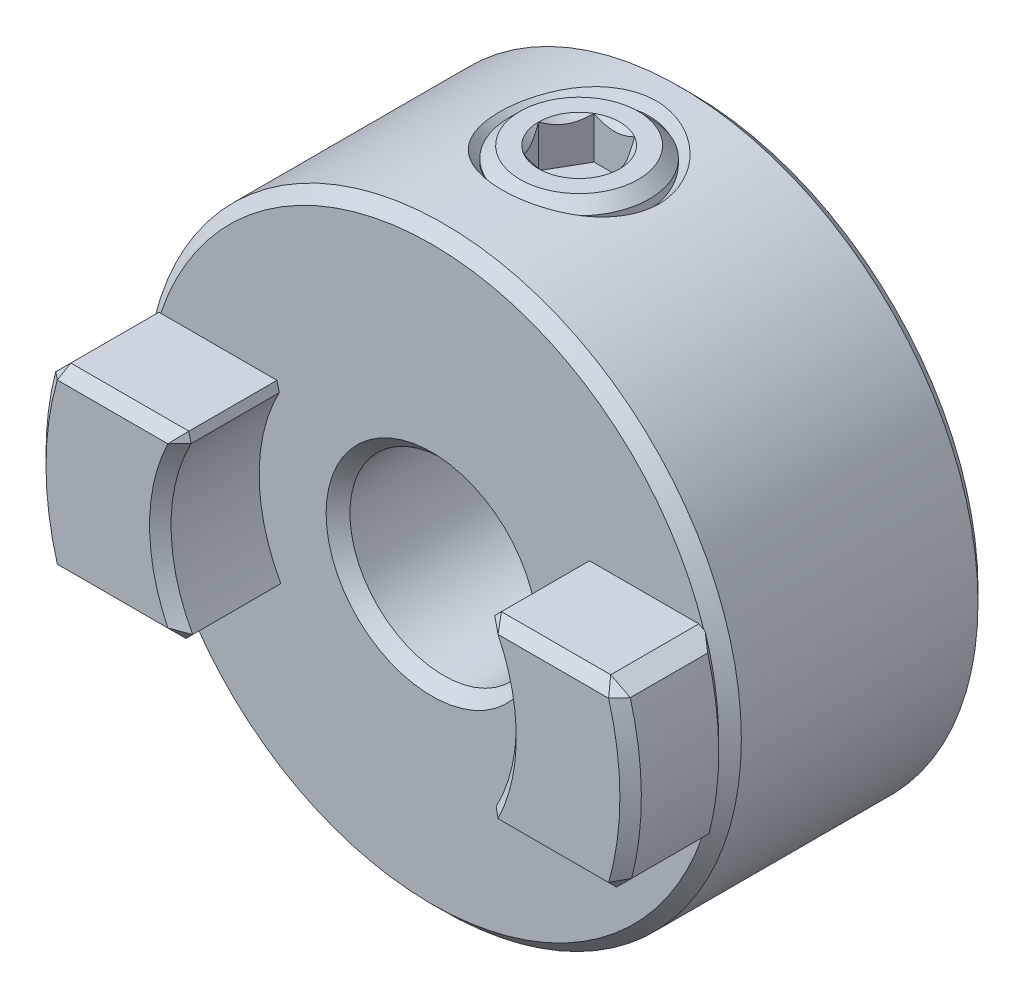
ISO-10303-21;
HEADER;
FILE_DESCRIPTION(('STEP AP214'),'2;1');
FILE_NAME('part.step','',(''),(''),'','','');
FILE_SCHEMA(('AUTOMOTIVE_DESIGN { 1 0 10303 214 1 1 1 1 }'));
ENDSEC;
DATA;
#1=APPLICATION_CONTEXT('core data for automotive mechanical design processes');
#2=APPLICATION_PROTOCOL_DEFINITION('international standard','automotive_design',2000,#1);
#3=PRODUCT_CONTEXT('',#1,'mechanical');
#4=PRODUCT('Part','Part','',(#3));
#5=PRODUCT_RELATED_PRODUCT_CATEGORY('part','',(#4));
#6=PRODUCT_DEFINITION_FORMATION('','',#4);
#7=PRODUCT_DEFINITION_CONTEXT('part definition',#1,'design');
#8=PRODUCT_DEFINITION('design','',#6,#7);
#9=PRODUCT_DEFINITION_SHAPE('','',#8);
#10=(LENGTH_UNIT() NAMED_UNIT(*) SI_UNIT(.MILLI.,.METRE.));
#11=(NAMED_UNIT(*) PLANE_ANGLE_UNIT() SI_UNIT($,.RADIAN.));
#12=(NAMED_UNIT(*) SI_UNIT($,.STERADIAN.) SOLID_ANGLE_UNIT());
#13=UNCERTAINTY_MEASURE_WITH_UNIT(LENGTH_MEASURE(1.E-05),#10,'distance_accuracy_value','');
#14=(GEOMETRIC_REPRESENTATION_CONTEXT(3) GLOBAL_UNCERTAINTY_ASSIGNED_CONTEXT((#13)) GLOBAL_UNIT_ASSIGNED_CONTEXT((#10,
#11,#12)) REPRESENTATION_CONTEXT('',''));
#15=CARTESIAN_POINT('',(0.,0.,0.));
#16=DIRECTION('',(0.,0.,1.));
#17=DIRECTION('',(1.,0.,0.));
#18=AXIS2_PLACEMENT_3D('',#15,#16,#17);
#19=CARTESIAN_POINT('',(0.,2.35,-5.5245));
#20=DIRECTION('',(0.,1.,0.));
#21=DIRECTION('',(0.,0.,1.));
#22=AXIS2_PLACEMENT_3D('',#19,#20,#21);
#23=CYLINDRICAL_SURFACE('',#22,1.5);
#24=CARTESIAN_POINT('',(0.,2.86,-5.5245));
#25=DIRECTION('',(0.,1.,0.));
#26=DIRECTION('',(0.,0.,1.));
#27=AXIS2_PLACEMENT_3D('',#24,#25,#26);
#28=CIRCLE('',#27,1.5);
#29=CARTESIAN_POINT('',(0.,2.86,-4.0245));
#30=VERTEX_POINT('',#29);
#31=EDGE_CURVE('E56',#30,#30,#28,.T.);
#32=ORIENTED_EDGE('',*,*,#31,.T.);
#33=EDGE_LOOP('',(#32));
#34=FACE_BOUND('',#33,.T.);
#35=CARTESIAN_POINT('',(0.,6.11,-5.5245));
#36=DIRECTION('',(0.,1.,0.));
#37=DIRECTION('',(0.,0.,1.));
#38=AXIS2_PLACEMENT_3D('',#35,#36,#37);
#39=CIRCLE('',#38,1.5);
#40=CARTESIAN_POINT('',(0.,6.11,-4.0245));
#41=VERTEX_POINT('',#40);
#42=EDGE_CURVE('E231',#41,#41,#39,.F.);
#43=ORIENTED_EDGE('',*,*,#42,.T.);
#44=EDGE_LOOP('',(#43));
#45=FACE_BOUND('',#44,.T.);
#46=ADVANCED_FACE('F48',(#34,#45),#23,.T.);
#47=CARTESIAN_POINT('',(0.,2.35,-5.5245));
#48=DIRECTION('',(0.,1.,0.));
#49=DIRECTION('',(0.,0.,1.));
#50=AXIS2_PLACEMENT_3D('',#47,#48,#49);
#51=PLANE('',#50);
#52=CARTESIAN_POINT('',(0.,2.35,-5.5245));
#53=DIRECTION('',(0.,1.,0.));
#54=DIRECTION('',(0.,0.,1.));
#55=AXIS2_PLACEMENT_3D('',#52,#53,#54);
#56=CIRCLE('',#55,0.99);
#57=CARTESIAN_POINT('',(0.,2.35,-4.5345));
#58=VERTEX_POINT('',#57);
#59=EDGE_CURVE('E13',#58,#58,#56,.F.);
#60=ORIENTED_EDGE('',*,*,#59,.T.);
#61=EDGE_LOOP('',(#60));
#62=FACE_BOUND('',#61,.T.);
#63=ADVANCED_FACE('F209',(#62),#51,.F.);
#64=CARTESIAN_POINT('',(0.,6.35,-5.5245));
#65=DIRECTION('',(0.,1.,0.));
#66=DIRECTION('',(0.,0.,1.));
#67=AXIS2_PLACEMENT_3D('',#64,#65,#66);
#68=PLANE('',#67);
#69=CARTESIAN_POINT('',(0.,6.35,-5.5245));
#70=DIRECTION('',(0.,1.,0.));
#71=DIRECTION('',(0.,0.,1.));
#72=AXIS2_PLACEMENT_3D('',#69,#70,#71);
#73=CIRCLE('',#72,1.26);
#74=CARTESIAN_POINT('',(0.,6.35,-4.2645));
#75=VERTEX_POINT('',#74);
#76=EDGE_CURVE('E122',#75,#75,#73,.T.);
#77=ORIENTED_EDGE('',*,*,#76,.T.);
#78=EDGE_LOOP('',(#77));
#79=FACE_BOUND('',#78,.T.);
#80=CARTESIAN_POINT('',(0.,6.35,-5.5245));
#81=DIRECTION('',(0.,1.,0.));
#82=DIRECTION('',(0.,0.,1.));
#83=AXIS2_PLACEMENT_3D('',#80,#81,#82);
#84=CIRCLE('',#83,0.866025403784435);
#85=CARTESIAN_POINT('',(0.433012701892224,6.35,-4.77450000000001));
#86=VERTEX_POINT('',#85);
#87=CARTESIAN_POINT('',(0.866025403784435,6.35,-5.52449999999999));
#88=VERTEX_POINT('',#87);
#89=EDGE_CURVE('E113',#86,#88,#84,.T.);
#90=ORIENTED_EDGE('',*,*,#89,.F.);
#91=CARTESIAN_POINT('',(-0.433012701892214,6.35,-4.7745));
#92=VERTEX_POINT('',#91);
#93=EDGE_CURVE('E102',#92,#86,#84,.T.);
#94=ORIENTED_EDGE('',*,*,#93,.F.);
#95=CARTESIAN_POINT('',(-0.866025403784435,6.35,-5.5245));
#96=VERTEX_POINT('',#95);
#97=EDGE_CURVE('E111',#96,#92,#84,.T.);
#98=ORIENTED_EDGE('',*,*,#97,.F.);
#99=CARTESIAN_POINT('',(-0.433012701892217,6.35,-6.2745));
#100=VERTEX_POINT('',#99);
#101=EDGE_CURVE('E62',#100,#96,#84,.T.);
#102=ORIENTED_EDGE('',*,*,#101,.F.);
#103=CARTESIAN_POINT('',(0.433012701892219,6.35,-6.2745));
#104=VERTEX_POINT('',#103);
#105=EDGE_CURVE('E69',#104,#100,#84,.T.);
#106=ORIENTED_EDGE('',*,*,#105,.F.);
#107=EDGE_CURVE('E143',#88,#104,#84,.T.);
#108=ORIENTED_EDGE('',*,*,#107,.F.);
#109=EDGE_LOOP('',(#90,#94,#98,#102,#106,#108));
#110=FACE_BOUND('',#109,.T.);
#111=ADVANCED_FACE('F142',(#79,#110),#68,.T.);
#112=CARTESIAN_POINT('',(0.,6.35,-5.5245));
#113=DIRECTION('',(0.,1.,0.));
#114=DIRECTION('',(0.,0.,1.));
#115=AXIS2_PLACEMENT_3D('',#112,#113,#114);
#116=CONICAL_SURFACE('',#115,0.866025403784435,0.78539816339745);
#117=ORIENTED_EDGE('',*,*,#89,.T.);
#118=CARTESIAN_POINT('',(0.432897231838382,6.35011549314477,-4.7743));
#119=CARTESIAN_POINT('',(0.44778707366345,6.33523411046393,-4.80008996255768));
#120=CARTESIAN_POINT('',(0.462925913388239,6.32122626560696,-4.82631120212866));
#121=CARTESIAN_POINT('',(0.49379596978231,6.29557752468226,-4.87977970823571));
#122=CARTESIAN_POINT('',(0.509530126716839,6.28395091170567,-4.90703206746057));
#123=CARTESIAN_POINT('',(0.541257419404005,6.26403404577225,-4.96198535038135));
#124=CARTESIAN_POINT('',(0.557242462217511,6.25569369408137,-4.98967225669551));
#125=CARTESIAN_POINT('',(0.589564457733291,6.24284274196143,-5.04565559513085));
#126=CARTESIAN_POINT('',(0.605900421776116,6.23832254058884,-5.07395031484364));
#127=CARTESIAN_POINT('',(0.634052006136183,6.23424583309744,-5.12271028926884));
#128=CARTESIAN_POINT('',(0.645830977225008,6.23364279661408,-5.14311206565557));
#129=CARTESIAN_POINT('',(0.669366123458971,6.23465450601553,-5.18387613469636));
#130=CARTESIAN_POINT('',(0.681122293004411,6.23626974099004,-5.20423841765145));
#131=CARTESIAN_POINT('',(0.716222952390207,6.24433614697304,-5.26503454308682));
#132=CARTESIAN_POINT('',(0.73939277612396,6.25400893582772,-5.3051658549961));
#133=CARTESIAN_POINT('',(0.7800639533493,6.27735631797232,-5.37561040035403));
#134=CARTESIAN_POINT('',(0.797755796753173,6.28980855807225,-5.40625357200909));
#135=CARTESIAN_POINT('',(0.832446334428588,6.31785961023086,-5.46633934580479));
#136=CARTESIAN_POINT('',(0.8494470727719,6.33344818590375,-5.49578548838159));
#137=CARTESIAN_POINT('',(0.866140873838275,6.35011549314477,-5.5247));
#138=B_SPLINE_CURVE_WITH_KNOTS('',3,(#118,#119,#120,#121,#122,#123,#124,#125,#126,#127,#128,
#129,#130,#131,#132,#133,#134,#135,#136,#137),.UNSPECIFIED.,.F.,.F.,(4,2,2,2,2,2,2,2,2,4),(0.,
0.0999419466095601,0.200466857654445,0.299393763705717,0.39807129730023,0.468665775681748,
0.53927582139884,0.680536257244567,0.792918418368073,0.904939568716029),.UNSPECIFIED.);
#139=EDGE_CURVE('E117',#86,#88,#138,.T.);
#140=ORIENTED_EDGE('',*,*,#139,.F.);
#141=EDGE_LOOP('',(#117,#140));
#142=FACE_BOUND('',#141,.T.);
#143=ADVANCED_FACE('F118',(#142),#116,.F.);
#144=ORIENTED_EDGE('',*,*,#107,.T.);
#145=CARTESIAN_POINT('',(0.866140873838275,6.35011549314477,-5.5243));
#146=CARTESIAN_POINT('',(0.851251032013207,6.33523411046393,-5.55008996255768));
#147=CARTESIAN_POINT('',(0.836112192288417,6.32122626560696,-5.57631120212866));
#148=CARTESIAN_POINT('',(0.805242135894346,6.29557752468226,-5.6297797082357));
#149=CARTESIAN_POINT('',(0.789507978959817,6.28395091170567,-5.65703206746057));
#150=CARTESIAN_POINT('',(0.757780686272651,6.26403404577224,-5.71198535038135));
#151=CARTESIAN_POINT('',(0.741795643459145,6.25569369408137,-5.73967225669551));
#152=CARTESIAN_POINT('',(0.709473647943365,6.24284274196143,-5.79565559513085));
#153=CARTESIAN_POINT('',(0.69313768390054,6.23832254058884,-5.82395031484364));
#154=CARTESIAN_POINT('',(0.664986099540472,6.23424583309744,-5.87271028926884));
#155=CARTESIAN_POINT('',(0.653207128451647,6.23364279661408,-5.89311206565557));
#156=CARTESIAN_POINT('',(0.629671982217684,6.23465450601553,-5.93387613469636));
#157=CARTESIAN_POINT('',(0.617915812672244,6.23626974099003,-5.95423841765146));
#158=CARTESIAN_POINT('',(0.582815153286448,6.24433614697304,-6.01503454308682));
#159=CARTESIAN_POINT('',(0.559645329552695,6.25400893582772,-6.0551658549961));
#160=CARTESIAN_POINT('',(0.518974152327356,6.27735631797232,-6.12561040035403));
#161=CARTESIAN_POINT('',(0.501282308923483,6.28980855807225,-6.15625357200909));
#162=CARTESIAN_POINT('',(0.466591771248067,6.31785961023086,-6.21633934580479));
#163=CARTESIAN_POINT('',(0.449591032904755,6.33344818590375,-6.24578548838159));
#164=CARTESIAN_POINT('',(0.43289723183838,6.35011549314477,-6.2747));
#165=B_SPLINE_CURVE_WITH_KNOTS('',3,(#145,#146,#147,#148,#149,#150,#151,#152,#153,#154,#155,
#156,#157,#158,#159,#160,#161,#162,#163,#164),.UNSPECIFIED.,.F.,.F.,(4,2,2,2,2,2,2,2,2,4),(0.,
0.0999419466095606,0.200466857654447,0.299393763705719,0.398071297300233,0.46866577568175,
0.539275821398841,0.680536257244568,0.792918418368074,0.90493956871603),.UNSPECIFIED.);
#166=EDGE_CURVE('E144',#88,#104,#165,.T.);
#167=ORIENTED_EDGE('',*,*,#166,.F.);
#168=EDGE_LOOP('',(#144,#167));
#169=FACE_BOUND('',#168,.T.);
#170=ADVANCED_FACE('F242',(#169),#116,.F.);
#171=ORIENTED_EDGE('',*,*,#105,.T.);
#172=CARTESIAN_POINT('',(-0.863604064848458,6.62778925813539,-6.2745));
#173=CARTESIAN_POINT('',(-0.842575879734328,6.61191493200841,-6.2745));
#174=CARTESIAN_POINT('',(-0.821430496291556,6.596196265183,-6.2745));
#175=CARTESIAN_POINT('',(-0.778857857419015,6.56513452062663,-6.2745));
#176=CARTESIAN_POINT('',(-0.757430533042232,6.54979153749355,-6.2745));
#177=CARTESIAN_POINT('',(-0.692340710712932,6.50420358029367,-6.2745));
#178=CARTESIAN_POINT('',(-0.648190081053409,6.47464409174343,-6.2745));
#179=CARTESIAN_POINT('',(-0.555607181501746,6.4166155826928,-6.2745));
#180=CARTESIAN_POINT('',(-0.507074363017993,6.38830510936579,-6.2745));
#181=CARTESIAN_POINT('',(-0.407587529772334,6.33651811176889,-6.2745));
#182=CARTESIAN_POINT('',(-0.356642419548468,6.31302529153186,-6.2745));
#183=CARTESIAN_POINT('',(-0.280165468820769,6.28428689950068,-6.2745));
#184=CARTESIAN_POINT('',(-0.25577002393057,6.27603927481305,-6.2745));
#185=CARTESIAN_POINT('',(-0.20640327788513,6.26149717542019,-6.2745));
#186=CARTESIAN_POINT('',(-0.181431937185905,6.25520283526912,-6.2745));
#187=CARTESIAN_POINT('',(-0.106699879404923,6.2399931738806,-6.2745));
#188=CARTESIAN_POINT('',(-0.0561907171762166,6.2343771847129,-6.2745));
#189=CARTESIAN_POINT('',(0.0430767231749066,6.23362825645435,-6.2745));
#190=CARTESIAN_POINT('',(0.0918322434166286,6.23812345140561,-6.2745));
#191=CARTESIAN_POINT('',(0.164112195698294,6.25133730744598,-6.2745));
#192=CARTESIAN_POINT('',(0.188278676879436,6.25690144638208,-6.2745));
#193=CARTESIAN_POINT('',(0.23609448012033,6.26992316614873,-6.2745));
#194=CARTESIAN_POINT('',(0.259743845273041,6.27738058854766,-6.2745));
#195=CARTESIAN_POINT('',(0.334198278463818,6.30366646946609,-6.2745));
#196=CARTESIAN_POINT('',(0.383940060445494,6.32549033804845,-6.2745));
#197=CARTESIAN_POINT('',(0.481089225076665,6.37401180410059,-6.2745));
#198=CARTESIAN_POINT('',(0.528487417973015,6.40072691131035,-6.2745));
#199=CARTESIAN_POINT('',(0.619071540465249,6.45584285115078,-6.2745));
#200=CARTESIAN_POINT('',(0.662349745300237,6.48409394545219,-6.2745));
#201=CARTESIAN_POINT('',(0.726111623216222,6.5277671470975,-6.2745));
#202=CARTESIAN_POINT('',(0.747090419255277,6.5424788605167,-6.2745));
#203=CARTESIAN_POINT('',(0.788761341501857,6.5722913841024,-6.2745));
#204=CARTESIAN_POINT('',(0.809453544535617,6.58739208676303,-6.2745));
#205=CARTESIAN_POINT('',(0.830026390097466,6.60265408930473,-6.2745));
#206=B_SPLINE_CURVE_WITH_KNOTS('',3,(#172,#173,#174,#175,#176,#177,#178,#179,#180,#181,#182,
#183,#184,#185,#186,#187,#188,#189,#190,#191,#192,#193,#194,#195,#196,#197,#198,#199,#200,#201,
#202,#203,#204,#205),.UNSPECIFIED.,.F.,.F.,(4,2,2,2,2,2,2,2,2,2,2,2,2,2,2,2,4),(0.,
0.0790398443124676,0.158099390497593,0.317425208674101,0.485845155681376,0.653685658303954,
0.730869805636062,0.808059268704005,0.959469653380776,1.10540290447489,1.17973203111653,
1.25405493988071,1.41653726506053,1.57961304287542,1.73458511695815,1.81145152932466,
1.8882969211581),.UNSPECIFIED.);
#207=EDGE_CURVE('E146',#104,#100,#206,.F.);
#208=ORIENTED_EDGE('',*,*,#207,.F.);
#209=EDGE_LOOP('',(#171,#208));
#210=FACE_BOUND('',#209,.T.);
#211=ADVANCED_FACE('F246',(#210),#116,.F.);
#212=ORIENTED_EDGE('',*,*,#101,.T.);
#213=CARTESIAN_POINT('',(-0.432897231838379,6.35011549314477,-6.2747));
#214=CARTESIAN_POINT('',(-0.447787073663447,6.33523411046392,-6.24891003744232));
#215=CARTESIAN_POINT('',(-0.462925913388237,6.32122626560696,-6.22268879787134));
#216=CARTESIAN_POINT('',(-0.493795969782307,6.29557752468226,-6.16922029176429));
#217=CARTESIAN_POINT('',(-0.509530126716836,6.28395091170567,-6.14196793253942));
#218=CARTESIAN_POINT('',(-0.541257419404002,6.26403404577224,-6.08701464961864));
#219=CARTESIAN_POINT('',(-0.557242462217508,6.25569369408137,-6.05932774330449));
#220=CARTESIAN_POINT('',(-0.589564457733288,6.24284274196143,-6.00334440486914));
#221=CARTESIAN_POINT('',(-0.605900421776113,6.23832254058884,-5.97504968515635));
#222=CARTESIAN_POINT('',(-0.63405200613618,6.23424583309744,-5.92628971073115));
#223=CARTESIAN_POINT('',(-0.645830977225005,6.23364279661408,-5.90588793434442));
#224=CARTESIAN_POINT('',(-0.669366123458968,6.23465450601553,-5.86512386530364));
#225=CARTESIAN_POINT('',(-0.681122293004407,6.23626974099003,-5.84476158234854));
#226=CARTESIAN_POINT('',(-0.716222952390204,6.24433614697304,-5.78396545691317));
#227=CARTESIAN_POINT('',(-0.739392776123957,6.25400893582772,-5.7438341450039));
#228=CARTESIAN_POINT('',(-0.780063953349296,6.27735631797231,-5.67338959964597));
#229=CARTESIAN_POINT('',(-0.797755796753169,6.28980855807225,-5.64274642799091));
#230=CARTESIAN_POINT('',(-0.832446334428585,6.31785961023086,-5.58266065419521));
#231=CARTESIAN_POINT('',(-0.849447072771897,6.33344818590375,-5.55321451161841));
#232=CARTESIAN_POINT('',(-0.866140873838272,6.35011549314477,-5.5243));
#233=B_SPLINE_CURVE_WITH_KNOTS('',3,(#213,#214,#215,#216,#217,#218,#219,#220,#221,#222,#223,
#224,#225,#226,#227,#228,#229,#230,#231,#232),.UNSPECIFIED.,.F.,.F.,(4,2,2,2,2,2,2,2,2,4),(0.,
0.0999419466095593,0.200466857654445,0.299393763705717,0.398071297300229,0.468665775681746,
0.539275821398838,0.680536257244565,0.792918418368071,0.904939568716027),.UNSPECIFIED.);
#234=EDGE_CURVE('E177',#100,#96,#233,.T.);
#235=ORIENTED_EDGE('',*,*,#234,.F.);
#236=EDGE_LOOP('',(#212,#235));
#237=FACE_BOUND('',#236,.T.);
#238=ADVANCED_FACE('F251',(#237),#116,.F.);
#239=ORIENTED_EDGE('',*,*,#97,.T.);
#240=CARTESIAN_POINT('',(-0.866140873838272,6.35011549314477,-5.5247));
#241=CARTESIAN_POINT('',(-0.851251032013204,6.33523411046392,-5.49891003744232));
#242=CARTESIAN_POINT('',(-0.836112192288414,6.32122626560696,-5.47268879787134));
#243=CARTESIAN_POINT('',(-0.805242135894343,6.29557752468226,-5.41922029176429));
#244=CARTESIAN_POINT('',(-0.789507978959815,6.28395091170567,-5.39196793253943));
#245=CARTESIAN_POINT('',(-0.757780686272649,6.26403404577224,-5.33701464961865));
#246=CARTESIAN_POINT('',(-0.741795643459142,6.25569369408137,-5.30932774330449));
#247=CARTESIAN_POINT('',(-0.709473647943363,6.24284274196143,-5.25334440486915));
#248=CARTESIAN_POINT('',(-0.693137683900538,6.23832254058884,-5.22504968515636));
#249=CARTESIAN_POINT('',(-0.66498609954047,6.23424583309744,-5.17628971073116));
#250=CARTESIAN_POINT('',(-0.653207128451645,6.23364279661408,-5.15588793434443));
#251=CARTESIAN_POINT('',(-0.629671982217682,6.23465450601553,-5.11512386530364));
#252=CARTESIAN_POINT('',(-0.617915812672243,6.23626974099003,-5.09476158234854));
#253=CARTESIAN_POINT('',(-0.582815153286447,6.24433614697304,-5.03396545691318));
#254=CARTESIAN_POINT('',(-0.559645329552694,6.25400893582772,-4.9938341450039));
#255=CARTESIAN_POINT('',(-0.518974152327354,6.27735631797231,-4.92338959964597));
#256=CARTESIAN_POINT('',(-0.501282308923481,6.28980855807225,-4.89274642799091));
#257=CARTESIAN_POINT('',(-0.466591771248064,6.31785961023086,-4.83266065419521));
#258=CARTESIAN_POINT('',(-0.449591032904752,6.33344818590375,-4.80321451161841));
#259=CARTESIAN_POINT('',(-0.432897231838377,6.35011549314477,-4.7743));
#260=B_SPLINE_CURVE_WITH_KNOTS('',3,(#240,#241,#242,#243,#244,#245,#246,#247,#248,#249,#250,
#251,#252,#253,#254,#255,#256,#257,#258,#259),.UNSPECIFIED.,.F.,.F.,(4,2,2,2,2,2,2,2,2,4),(0.,
0.0999419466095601,0.200466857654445,0.299393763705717,0.398071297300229,0.468665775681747,
0.539275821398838,0.680536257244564,0.792918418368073,0.904939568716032),.UNSPECIFIED.);
#261=EDGE_CURVE('E132',#96,#92,#260,.T.);
#262=ORIENTED_EDGE('',*,*,#261,.F.);
#263=EDGE_LOOP('',(#239,#262));
#264=FACE_BOUND('',#263,.T.);
#265=ADVANCED_FACE('F166',(#264),#116,.F.);
#266=ORIENTED_EDGE('',*,*,#93,.T.);
#267=CARTESIAN_POINT('',(-0.863604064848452,6.62778925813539,-4.7745));
#268=CARTESIAN_POINT('',(-0.842575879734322,6.61191493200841,-4.7745));
#269=CARTESIAN_POINT('',(-0.82143049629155,6.596196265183,-4.7745));
#270=CARTESIAN_POINT('',(-0.778857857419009,6.56513452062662,-4.7745));
#271=CARTESIAN_POINT('',(-0.757430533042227,6.54979153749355,-4.7745));
#272=CARTESIAN_POINT('',(-0.692340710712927,6.50420358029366,-4.7745));
#273=CARTESIAN_POINT('',(-0.648190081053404,6.47464409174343,-4.7745));
#274=CARTESIAN_POINT('',(-0.555607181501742,6.4166155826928,-4.7745));
#275=CARTESIAN_POINT('',(-0.507074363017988,6.38830510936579,-4.7745));
#276=CARTESIAN_POINT('',(-0.40758752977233,6.33651811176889,-4.7745));
#277=CARTESIAN_POINT('',(-0.356642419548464,6.31302529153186,-4.7745));
#278=CARTESIAN_POINT('',(-0.280165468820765,6.28428689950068,-4.7745));
#279=CARTESIAN_POINT('',(-0.255770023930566,6.27603927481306,-4.7745));
#280=CARTESIAN_POINT('',(-0.206403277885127,6.26149717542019,-4.7745));
#281=CARTESIAN_POINT('',(-0.181431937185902,6.25520283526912,-4.7745));
#282=CARTESIAN_POINT('',(-0.10669987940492,6.2399931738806,-4.7745));
#283=CARTESIAN_POINT('',(-0.0561907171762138,6.2343771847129,-4.7745));
#284=CARTESIAN_POINT('',(0.0430767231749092,6.23362825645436,-4.7745));
#285=CARTESIAN_POINT('',(0.0918322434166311,6.23812345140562,-4.7745));
#286=CARTESIAN_POINT('',(0.164112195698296,6.25133730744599,-4.7745));
#287=CARTESIAN_POINT('',(0.188278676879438,6.25690144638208,-4.7745));
#288=CARTESIAN_POINT('',(0.236094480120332,6.26992316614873,-4.7745));
#289=CARTESIAN_POINT('',(0.259743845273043,6.27738058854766,-4.7745));
#290=CARTESIAN_POINT('',(0.334198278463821,6.30366646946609,-4.7745));
#291=CARTESIAN_POINT('',(0.383940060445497,6.32549033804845,-4.7745));
#292=CARTESIAN_POINT('',(0.481089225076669,6.37401180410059,-4.7745));
#293=CARTESIAN_POINT('',(0.528487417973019,6.40072691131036,-4.7745));
#294=CARTESIAN_POINT('',(0.619071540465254,6.45584285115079,-4.7745));
#295=CARTESIAN_POINT('',(0.662349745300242,6.48409394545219,-4.7745));
#296=CARTESIAN_POINT('',(0.726111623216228,6.52776714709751,-4.7745));
#297=CARTESIAN_POINT('',(0.747090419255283,6.54247886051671,-4.7745));
#298=CARTESIAN_POINT('',(0.788761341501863,6.57229138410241,-4.7745));
#299=CARTESIAN_POINT('',(0.809453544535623,6.58739208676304,-4.7745));
#300=CARTESIAN_POINT('',(0.830026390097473,6.60265408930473,-4.7745));
#301=B_SPLINE_CURVE_WITH_KNOTS('',3,(#267,#268,#269,#270,#271,#272,#273,#274,#275,#276,#277,
#278,#279,#280,#281,#282,#283,#284,#285,#286,#287,#288,#289,#290,#291,#292,#293,#294,#295,#296,
#297,#298,#299,#300),.UNSPECIFIED.,.F.,.F.,(4,2,2,2,2,2,2,2,2,2,2,2,2,2,2,2,4),(0.,
0.0790398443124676,0.158099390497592,0.317425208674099,0.485845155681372,0.65368565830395,
0.730869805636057,0.808059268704,0.95946965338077,1.10540290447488,1.17973203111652,
1.25405493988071,1.41653726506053,1.57961304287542,1.73458511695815,1.81145152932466,
1.8882969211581),.UNSPECIFIED.);
#302=EDGE_CURVE('E106',#92,#86,#301,.T.);
#303=ORIENTED_EDGE('',*,*,#302,.F.);
#304=EDGE_LOOP('',(#266,#303));
#305=FACE_BOUND('',#304,.T.);
#306=ADVANCED_FACE('F104',(#305),#116,.F.);
#307=CARTESIAN_POINT('',(0.433012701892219,5.45,-4.7745));
#308=DIRECTION('',(0.,1.,0.));
#309=DIRECTION('',(0.,0.,1.));
#310=AXIS2_PLACEMENT_3D('',#307,#308,#309);
#311=PLANE('',#310);
#312=DIRECTION('',(1.,0.,0.));
#313=VECTOR('',#312,1.);
#314=CARTESIAN_POINT('',(-0.433012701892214,5.45,-4.7745));
#315=LINE('',#314,#313);
#316=CARTESIAN_POINT('',(-0.433012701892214,5.45,-4.7745));
#317=VERTEX_POINT('',#316);
#318=CARTESIAN_POINT('',(0.433012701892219,5.45,-4.7745));
#319=VERTEX_POINT('',#318);
#320=EDGE_CURVE('E131',#317,#319,#315,.T.);
#321=ORIENTED_EDGE('',*,*,#320,.T.);
#322=DIRECTION('',(0.499999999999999,0.,-0.866025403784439));
#323=VECTOR('',#322,1.);
#324=CARTESIAN_POINT('',(0.433012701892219,5.45,-4.7745));
#325=LINE('',#324,#323);
#326=CARTESIAN_POINT('',(0.866025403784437,5.45,-5.5245));
#327=VERTEX_POINT('',#326);
#328=EDGE_CURVE('E136',#319,#327,#325,.T.);
#329=ORIENTED_EDGE('',*,*,#328,.T.);
#330=DIRECTION('',(-0.5,0.,-0.866025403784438));
#331=VECTOR('',#330,1.);
#332=CARTESIAN_POINT('',(0.866025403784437,5.45,-5.5245));
#333=LINE('',#332,#331);
#334=CARTESIAN_POINT('',(0.433012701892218,5.45,-6.2745));
#335=VERTEX_POINT('',#334);
#336=EDGE_CURVE('E279',#327,#335,#333,.T.);
#337=ORIENTED_EDGE('',*,*,#336,.T.);
#338=DIRECTION('',(-1.,0.,0.));
#339=VECTOR('',#338,1.);
#340=CARTESIAN_POINT('',(0.433012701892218,5.45,-6.2745));
#341=LINE('',#340,#339);
#342=CARTESIAN_POINT('',(-0.433012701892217,5.45,-6.2745));
#343=VERTEX_POINT('',#342);
#344=EDGE_CURVE('E258',#335,#343,#341,.T.);
#345=ORIENTED_EDGE('',*,*,#344,.T.);
#346=DIRECTION('',(-0.5,0.,0.866025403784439));
#347=VECTOR('',#346,1.);
#348=CARTESIAN_POINT('',(-0.433012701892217,5.45,-6.2745));
#349=LINE('',#348,#347);
#350=CARTESIAN_POINT('',(-0.866025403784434,5.45,-5.5245));
#351=VERTEX_POINT('',#350);
#352=EDGE_CURVE('E276',#343,#351,#349,.T.);
#353=ORIENTED_EDGE('',*,*,#352,.T.);
#354=DIRECTION('',(0.5,0.,0.866025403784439));
#355=VECTOR('',#354,1.);
#356=CARTESIAN_POINT('',(-0.866025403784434,5.45,-5.5245));
#357=LINE('',#356,#355);
#358=EDGE_CURVE('E139',#351,#317,#357,.T.);
#359=ORIENTED_EDGE('',*,*,#358,.T.);
#360=EDGE_LOOP('',(#321,#329,#337,#345,#353,#359));
#361=FACE_BOUND('',#360,.T.);
#362=ADVANCED_FACE('F165',(#361),#311,.T.);
#363=CARTESIAN_POINT('',(0.433012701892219,5.45,-4.7745));
#364=DIRECTION('',(0.866025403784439,0.,0.499999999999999));
#365=DIRECTION('',(0.499999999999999,0.,-0.866025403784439));
#366=AXIS2_PLACEMENT_3D('',#363,#364,#365);
#367=PLANE('',#366);
#368=DIRECTION('',(0.,1.,0.));
#369=VECTOR('',#368,1.);
#370=CARTESIAN_POINT('',(0.433012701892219,5.45,-4.7745));
#371=LINE('',#370,#369);
#372=EDGE_CURVE('E128',#319,#86,#371,.T.);
#373=ORIENTED_EDGE('',*,*,#372,.T.);
#374=ORIENTED_EDGE('',*,*,#139,.T.);
#375=DIRECTION('',(0.,1.,0.));
#376=VECTOR('',#375,1.);
#377=CARTESIAN_POINT('',(0.866025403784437,5.45,-5.5245));
#378=LINE('',#377,#376);
#379=EDGE_CURVE('E138',#327,#88,#378,.T.);
#380=ORIENTED_EDGE('',*,*,#379,.F.);
#381=ORIENTED_EDGE('',*,*,#328,.F.);
#382=EDGE_LOOP('',(#373,#374,#380,#381));
#383=FACE_BOUND('',#382,.T.);
#384=ADVANCED_FACE('F134',(#383),#367,.F.);
#385=CARTESIAN_POINT('',(0.866025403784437,5.45,-5.5245));
#386=DIRECTION('',(0.866025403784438,0.,-0.5));
#387=DIRECTION('',(-0.5,0.,-0.866025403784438));
#388=AXIS2_PLACEMENT_3D('',#385,#386,#387);
#389=PLANE('',#388);
#390=ORIENTED_EDGE('',*,*,#379,.T.);
#391=ORIENTED_EDGE('',*,*,#166,.T.);
#392=DIRECTION('',(0.,1.,0.));
#393=VECTOR('',#392,1.);
#394=CARTESIAN_POINT('',(0.433012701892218,5.45,-6.2745));
#395=LINE('',#394,#393);
#396=EDGE_CURVE('E255',#335,#104,#395,.T.);
#397=ORIENTED_EDGE('',*,*,#396,.F.);
#398=ORIENTED_EDGE('',*,*,#336,.F.);
#399=EDGE_LOOP('',(#390,#391,#397,#398));
#400=FACE_BOUND('',#399,.T.);
#401=ADVANCED_FACE('F159',(#400),#389,.F.);
#402=CARTESIAN_POINT('',(0.433012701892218,5.45,-6.2745));
#403=DIRECTION('',(0.,0.,-1.));
#404=DIRECTION('',(-1.,0.,0.));
#405=AXIS2_PLACEMENT_3D('',#402,#403,#404);
#406=PLANE('',#405);
#407=ORIENTED_EDGE('',*,*,#396,.T.);
#408=ORIENTED_EDGE('',*,*,#207,.T.);
#409=DIRECTION('',(0.,1.,0.));
#410=VECTOR('',#409,1.);
#411=CARTESIAN_POINT('',(-0.433012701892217,5.45,-6.2745));
#412=LINE('',#411,#410);
#413=EDGE_CURVE('E260',#343,#100,#412,.T.);
#414=ORIENTED_EDGE('',*,*,#413,.F.);
#415=ORIENTED_EDGE('',*,*,#344,.F.);
#416=EDGE_LOOP('',(#407,#408,#414,#415));
#417=FACE_BOUND('',#416,.T.);
#418=ADVANCED_FACE('F198',(#417),#406,.F.);
#419=CARTESIAN_POINT('',(-0.433012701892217,5.45,-6.2745));
#420=DIRECTION('',(-0.866025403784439,0.,-0.5));
#421=DIRECTION('',(-0.5,0.,0.866025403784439));
#422=AXIS2_PLACEMENT_3D('',#419,#420,#421);
#423=PLANE('',#422);
#424=ORIENTED_EDGE('',*,*,#413,.T.);
#425=ORIENTED_EDGE('',*,*,#234,.T.);
#426=DIRECTION('',(0.,1.,0.));
#427=VECTOR('',#426,1.);
#428=CARTESIAN_POINT('',(-0.866025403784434,5.45,-5.5245));
#429=LINE('',#428,#427);
#430=EDGE_CURVE('E266',#351,#96,#429,.T.);
#431=ORIENTED_EDGE('',*,*,#430,.F.);
#432=ORIENTED_EDGE('',*,*,#352,.F.);
#433=EDGE_LOOP('',(#424,#425,#431,#432));
#434=FACE_BOUND('',#433,.T.);
#435=ADVANCED_FACE('F194',(#434),#423,.F.);
#436=CARTESIAN_POINT('',(-0.866025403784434,5.45,-5.5245));
#437=DIRECTION('',(-0.866025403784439,0.,0.5));
#438=DIRECTION('',(0.5,0.,0.866025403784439));
#439=AXIS2_PLACEMENT_3D('',#436,#437,#438);
#440=PLANE('',#439);
#441=ORIENTED_EDGE('',*,*,#430,.T.);
#442=ORIENTED_EDGE('',*,*,#261,.T.);
#443=DIRECTION('',(0.,1.,0.));
#444=VECTOR('',#443,1.);
#445=CARTESIAN_POINT('',(-0.433012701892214,5.45,-4.7745));
#446=LINE('',#445,#444);
#447=EDGE_CURVE('E123',#317,#92,#446,.T.);
#448=ORIENTED_EDGE('',*,*,#447,.F.);
#449=ORIENTED_EDGE('',*,*,#358,.F.);
#450=EDGE_LOOP('',(#441,#442,#448,#449));
#451=FACE_BOUND('',#450,.T.);
#452=ADVANCED_FACE('F191',(#451),#440,.F.);
#453=CARTESIAN_POINT('',(-0.433012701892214,5.45,-4.7745));
#454=DIRECTION('',(0.,0.,1.));
#455=DIRECTION('',(1.,0.,0.));
#456=AXIS2_PLACEMENT_3D('',#453,#454,#455);
#457=PLANE('',#456);
#458=ORIENTED_EDGE('',*,*,#447,.T.);
#459=ORIENTED_EDGE('',*,*,#302,.T.);
#460=ORIENTED_EDGE('',*,*,#372,.F.);
#461=ORIENTED_EDGE('',*,*,#320,.F.);
#462=EDGE_LOOP('',(#458,#459,#460,#461));
#463=FACE_BOUND('',#462,.T.);
#464=ADVANCED_FACE('F126',(#463),#457,.F.);
#465=CARTESIAN_POINT('',(0.,6.35,-5.5245));
#466=DIRECTION('',(0.,-1.,0.));
#467=DIRECTION('',(0.,0.,-1.));
#468=AXIS2_PLACEMENT_3D('',#465,#466,#467);
#469=CONICAL_SURFACE('',#468,1.26,0.785398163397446);
#470=ORIENTED_EDGE('',*,*,#42,.F.);
#471=EDGE_LOOP('',(#470));
#472=FACE_BOUND('',#471,.T.);
#473=ORIENTED_EDGE('',*,*,#76,.F.);
#474=EDGE_LOOP('',(#473));
#475=FACE_BOUND('',#474,.T.);
#476=ADVANCED_FACE('F220',(#472,#475),#469,.T.);
#477=CARTESIAN_POINT('',(0.,2.86,-5.5245));
#478=DIRECTION('',(0.,1.,0.));
#479=DIRECTION('',(0.,0.,1.));
#480=AXIS2_PLACEMENT_3D('',#477,#478,#479);
#481=CONICAL_SURFACE('',#480,1.5,0.785398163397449);
#482=ORIENTED_EDGE('',*,*,#59,.F.);
#483=EDGE_LOOP('',(#482));
#484=FACE_BOUND('',#483,.T.);
#485=ORIENTED_EDGE('',*,*,#31,.F.);
#486=EDGE_LOOP('',(#485));
#487=FACE_BOUND('',#486,.T.);
#488=ADVANCED_FACE('F50',(#484,#487),#481,.T.);
#489=CLOSED_SHELL('',(#46,#63,#111,#143,#170,#211,#238,#265,#306,#362,#384,#401,#418,#435,#452,
#464,#476,#488));
#490=MANIFOLD_SOLID_BREP('B2',#489);
#491=CARTESIAN_POINT('',(0.,0.,-7.9375));
#492=DIRECTION('',(0.,0.,1.));
#493=DIRECTION('',(1.,0.,0.));
#494=AXIS2_PLACEMENT_3D('',#491,#492,#493);
#495=CYLINDRICAL_SURFACE('',#494,6.35);
#496=CARTESIAN_POINT('',(0.,6.35,-7.1699591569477));
#497=CARTESIAN_POINT('',(-0.0280217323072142,6.35000416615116,-7.16997675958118));
#498=CARTESIAN_POINT('',(-0.056042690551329,6.34979983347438,-7.16929590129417));
#499=CARTESIAN_POINT('',(-0.111958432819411,6.34899524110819,-7.16656027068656));
#500=CARTESIAN_POINT('',(-0.139853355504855,6.34839573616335,-7.16450811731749));
#501=CARTESIAN_POINT('',(-0.195458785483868,6.34682288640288,-7.15905681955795));
#502=CARTESIAN_POINT('',(-0.223169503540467,6.34585009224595,-7.15565965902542));
#503=CARTESIAN_POINT('',(-0.278349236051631,6.34355293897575,-7.14754581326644));
#504=CARTESIAN_POINT('',(-0.30581849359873,6.3422289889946,-7.14283066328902));
#505=CARTESIAN_POINT('',(-0.360457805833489,6.33925166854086,-7.13210791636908));
#506=CARTESIAN_POINT('',(-0.387628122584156,6.33759861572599,-7.12610156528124));
#507=CARTESIAN_POINT('',(-0.441612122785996,6.33398520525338,-7.11282339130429));
#508=CARTESIAN_POINT('',(-0.468426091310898,6.33202511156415,-7.10555265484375));
#509=CARTESIAN_POINT('',(-0.521639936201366,6.32781969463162,-7.08977254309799));
#510=CARTESIAN_POINT('',(-0.548040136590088,6.32557460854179,-7.08126419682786));
#511=CARTESIAN_POINT('',(-0.600368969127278,6.32082125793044,-7.06303560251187));
#512=CARTESIAN_POINT('',(-0.626297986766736,6.31831322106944,-7.05331640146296));
#513=CARTESIAN_POINT('',(-0.677626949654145,6.31305600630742,-7.0326927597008));
#514=CARTESIAN_POINT('',(-0.703027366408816,6.31030705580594,-7.02178943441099));
#515=CARTESIAN_POINT('',(-0.753241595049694,6.30459003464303,-6.99882415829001));
#516=CARTESIAN_POINT('',(-0.778055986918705,6.30162219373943,-6.98676341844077));
#517=CARTESIAN_POINT('',(-0.827040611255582,6.29548944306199,-6.96150989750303));
#518=CARTESIAN_POINT('',(-0.851211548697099,6.2923247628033,-6.94831842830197));
#519=CARTESIAN_POINT('',(-0.89885168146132,6.28582026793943,-6.92083004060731));
#520=CARTESIAN_POINT('',(-0.922321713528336,6.28248067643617,-6.90653451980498));
#521=CARTESIAN_POINT('',(-0.968502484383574,6.27564874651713,-6.87686458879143));
#522=CARTESIAN_POINT('',(-0.991214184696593,6.27215661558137,-6.86149162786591));
#523=CARTESIAN_POINT('',(-1.03582060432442,6.26504033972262,-6.82969358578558));
#524=CARTESIAN_POINT('',(-1.05771638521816,6.26141637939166,-6.81326995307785));
#525=CARTESIAN_POINT('',(-1.10063384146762,6.25406338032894,-6.77939673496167));
#526=CARTESIAN_POINT('',(-1.12165663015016,6.2503344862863,-6.76194852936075));
#527=CARTESIAN_POINT('',(-1.16276902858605,6.24277549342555,-6.72605483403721));
#528=CARTESIAN_POINT('',(-1.18285973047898,6.238945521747,-6.70761056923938));
#529=CARTESIAN_POINT('',(-1.22204585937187,6.23127625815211,-6.66975463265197));
#530=CARTESIAN_POINT('',(-1.24114275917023,6.22743698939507,-6.65034448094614));
#531=CARTESIAN_POINT('',(-1.27830759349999,6.2198434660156,-6.61061532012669));
#532=CARTESIAN_POINT('',(-1.29637734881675,6.21608906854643,-6.59029804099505));
#533=CARTESIAN_POINT('',(-1.33145840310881,6.20867146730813,-6.54881295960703));
#534=CARTESIAN_POINT('',(-1.34847142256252,6.20500812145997,-6.5276466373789));
#535=CARTESIAN_POINT('',(-1.38141143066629,6.19780179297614,-6.484519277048));
#536=CARTESIAN_POINT('',(-1.39734008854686,6.19425862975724,-6.46255954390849));
#537=CARTESIAN_POINT('',(-1.42808321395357,6.18731569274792,-6.41790175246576));
#538=CARTESIAN_POINT('',(-1.44289934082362,6.18391570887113,-6.39520486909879));
#539=CARTESIAN_POINT('',(-1.47138934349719,6.1772838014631,-6.34912895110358));
#540=CARTESIAN_POINT('',(-1.48506489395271,6.17405163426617,-6.32575098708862));
#541=CARTESIAN_POINT('',(-1.51124561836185,6.16777959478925,-6.27836910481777));
#542=CARTESIAN_POINT('',(-1.52375248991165,6.16473944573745,-6.25436616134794));
#543=CARTESIAN_POINT('',(-1.5475677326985,6.15887579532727,-6.20579049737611));
#544=CARTESIAN_POINT('',(-1.55887781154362,6.15605198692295,-6.1812186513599));
#545=CARTESIAN_POINT('',(-1.58027135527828,6.15064533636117,-6.13156136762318));
#546=CARTESIAN_POINT('',(-1.59035650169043,6.14806216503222,-6.10647669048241));
#547=CARTESIAN_POINT('',(-1.60927210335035,6.14316110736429,-6.05584994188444));
#548=CARTESIAN_POINT('',(-1.61810415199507,6.14084288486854,-6.03030849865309));
#549=CARTESIAN_POINT('',(-1.63448554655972,6.13649602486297,-5.97882443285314));
#550=CARTESIAN_POINT('',(-1.6420363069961,6.13446706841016,-5.95288228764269));
#551=CARTESIAN_POINT('',(-1.6558271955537,6.13072301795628,-5.9006530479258));
#552=CARTESIAN_POINT('',(-1.66206843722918,6.12900765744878,-5.87436626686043));
#553=CARTESIAN_POINT('',(-1.67321252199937,6.12591503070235,-5.82150399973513));
#554=CARTESIAN_POINT('',(-1.67811602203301,6.12453759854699,-5.79492866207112));
#555=CARTESIAN_POINT('',(-1.68655687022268,6.12214504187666,-5.74154550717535));
#556=CARTESIAN_POINT('',(-1.69009422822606,6.12112991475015,-5.71473769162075));
#557=CARTESIAN_POINT('',(-1.69577577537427,6.11948599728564,-5.66094584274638));
#558=CARTESIAN_POINT('',(-1.69791910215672,6.11885744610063,-5.6339617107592));
#559=CARTESIAN_POINT('',(-1.70078377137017,6.11801107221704,-5.5798732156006));
#560=CARTESIAN_POINT('',(-1.70150311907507,6.11779382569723,-5.55276873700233));
#561=CARTESIAN_POINT('',(-1.70149885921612,6.11779269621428,-5.49855948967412));
#562=CARTESIAN_POINT('',(-1.70077522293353,6.11800882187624,-5.47145472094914));
#563=CARTESIAN_POINT('',(-1.69791301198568,6.11885061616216,-5.41736437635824));
#564=CARTESIAN_POINT('',(-1.69577638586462,6.11947572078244,-5.39037868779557));
#565=CARTESIAN_POINT('',(-1.69011511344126,6.12111138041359,-5.3365821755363));
#566=CARTESIAN_POINT('',(-1.68659131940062,6.12212169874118,-5.30977125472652));
#567=CARTESIAN_POINT('',(-1.67818436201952,6.12450336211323,-5.25637999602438));
#568=CARTESIAN_POINT('',(-1.67330119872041,6.12587470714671,-5.22979965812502));
#569=CARTESIAN_POINT('',(-1.66220337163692,6.12895420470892,-5.17692517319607));
#570=CARTESIAN_POINT('',(-1.65598807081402,6.13066251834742,-5.1506311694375));
#571=CARTESIAN_POINT('',(-1.64225376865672,6.13439177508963,-5.09838493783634));
#572=CARTESIAN_POINT('',(-1.63473367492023,6.13641297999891,-5.07243301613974));
#573=CARTESIAN_POINT('',(-1.61841736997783,6.140743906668,-5.02092652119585));
#574=CARTESIAN_POINT('',(-1.60961975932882,6.14305394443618,-4.99537241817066));
#575=CARTESIAN_POINT('',(-1.59077586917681,6.14793846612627,-4.94471714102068));
#576=CARTESIAN_POINT('',(-1.58072799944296,6.15051328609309,-4.91961659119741));
#577=CARTESIAN_POINT('',(-1.5594109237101,6.15590333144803,-4.86992401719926));
#578=CARTESIAN_POINT('',(-1.54814002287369,6.15871888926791,-4.84533275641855));
#579=CARTESIAN_POINT('',(-1.52440413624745,6.1645663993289,-4.79671437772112));
#580=CARTESIAN_POINT('',(-1.51193740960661,6.16759866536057,-4.77268814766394));
#581=CARTESIAN_POINT('',(-1.48583706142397,6.17385556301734,-4.72525546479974));
#582=CARTESIAN_POINT('',(-1.47220168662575,6.17708048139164,-4.70185001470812));
#583=CARTESIAN_POINT('',(-1.44379121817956,6.18369877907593,-4.65571454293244));
#584=CARTESIAN_POINT('',(-1.42901437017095,6.1870924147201,-4.63298563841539));
#585=CARTESIAN_POINT('',(-1.39834805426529,6.194023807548,-4.58825889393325));
#586=CARTESIAN_POINT('',(-1.38245682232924,6.19756178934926,-4.566262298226));
#587=CARTESIAN_POINT('',(-1.3495890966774,6.20475917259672,-4.52305585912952));
#588=CARTESIAN_POINT('',(-1.33261080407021,6.20841877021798,-4.50184741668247));
#589=CARTESIAN_POINT('',(-1.29759540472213,6.21583055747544,-4.46027270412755));
#590=CARTESIAN_POINT('',(-1.27955642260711,6.21958290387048,-4.43990804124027));
#591=CARTESIAN_POINT('',(-1.24244963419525,6.22717428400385,-4.40007714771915));
#592=CARTESIAN_POINT('',(-1.22337983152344,6.23101347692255,-4.38061280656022));
#593=CARTESIAN_POINT('',(-1.18424184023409,6.23868419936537,-4.3426485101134));
#594=CARTESIAN_POINT('',(-1.16417211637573,6.24251570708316,-4.3241501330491));
#595=CARTESIAN_POINT('',(-1.12309456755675,6.25007865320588,-4.28815534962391));
#596=CARTESIAN_POINT('',(-1.10208569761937,6.25380997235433,-4.27066011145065));
#597=CARTESIAN_POINT('',(-1.05919095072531,6.26116864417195,-4.23669813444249));
#598=CARTESIAN_POINT('',(-1.03730398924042,6.26479585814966,-4.2202327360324));
#599=CARTESIAN_POINT('',(-0.992710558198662,6.27191937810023,-4.18835622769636));
#600=CARTESIAN_POINT('',(-0.97000304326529,6.27541550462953,-4.17294654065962));
#601=CARTESIAN_POINT('',(-0.923826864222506,6.28225608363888,-4.14320756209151));
#602=CARTESIAN_POINT('',(-0.900357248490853,6.2856003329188,-4.12887970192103));
#603=CARTESIAN_POINT('',(-0.852714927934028,6.29211472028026,-4.10133049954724));
#604=CARTESIAN_POINT('',(-0.82854139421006,6.2952846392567,-4.08811053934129));
#605=CARTESIAN_POINT('',(-0.779549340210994,6.30142836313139,-4.06280333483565));
#606=CARTESIAN_POINT('',(-0.754730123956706,6.30440194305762,-4.05071738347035));
#607=CARTESIAN_POINT('',(-0.70450478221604,6.31013085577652,-4.02770443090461));
#608=CARTESIAN_POINT('',(-0.679098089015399,6.31288596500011,-4.01677861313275));
#609=CARTESIAN_POINT('',(-0.627755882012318,6.31815582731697,-3.99611218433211));
#610=CARTESIAN_POINT('',(-0.601819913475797,6.32067036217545,-3.98637264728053));
#611=CARTESIAN_POINT('',(-0.549477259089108,6.32543695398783,-3.96810503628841));
#612=CARTESIAN_POINT('',(-0.523070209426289,6.32768879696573,-3.95957794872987));
#613=CARTESIAN_POINT('',(-0.469843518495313,6.33190788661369,-3.94376147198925));
#614=CARTESIAN_POINT('',(-0.443023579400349,6.33387491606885,-3.93647302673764));
#615=CARTESIAN_POINT('',(-0.389029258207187,6.33750226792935,-3.92316002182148));
#616=CARTESIAN_POINT('',(-0.361854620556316,6.33916235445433,-3.91713643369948));
#617=CARTESIAN_POINT('',(-0.307209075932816,6.34215372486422,-3.90637926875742));
#618=CARTESIAN_POINT('',(-0.279737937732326,6.34348472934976,-3.90164678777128));
#619=CARTESIAN_POINT('',(-0.224557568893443,6.3457958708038,-3.89349782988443));
#620=CARTESIAN_POINT('',(-0.196848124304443,6.34677564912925,-3.89008269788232));
#621=CARTESIAN_POINT('',(-0.141249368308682,6.34836229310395,-3.88459443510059));
#622=CARTESIAN_POINT('',(-0.113359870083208,6.3489686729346,-3.88252305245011));
#623=CARTESIAN_POINT('',(-0.0574590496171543,6.34978659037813,-3.87974764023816));
#624=CARTESIAN_POINT('',(-0.0294476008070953,6.34999745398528,-3.87904594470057));
#625=CARTESIAN_POINT('',(0.0265823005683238,6.35000222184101,-3.87903691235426));
#626=CARTESIAN_POINT('',(0.054600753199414,6.3497960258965,-3.87972991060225));
#627=CARTESIAN_POINT('',(0.110528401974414,6.34898722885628,-3.88248969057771));
#628=CARTESIAN_POINT('',(0.13843769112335,6.34838512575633,-3.88455474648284));
#629=CARTESIAN_POINT('',(0.19408721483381,6.34680691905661,-3.89003084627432));
#630=CARTESIAN_POINT('',(0.221827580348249,6.34583115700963,-3.89344066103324));
#631=CARTESIAN_POINT('',(0.277079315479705,6.34352789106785,-3.901579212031));
#632=CARTESIAN_POINT('',(0.304590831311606,6.34220063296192,-3.90630702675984));
#633=CARTESIAN_POINT('',(0.359324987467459,6.33921659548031,-3.91705456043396));
#634=CARTESIAN_POINT('',(0.38654778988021,6.33756001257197,-3.92307350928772));
#635=CARTESIAN_POINT('',(0.440644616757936,6.33393949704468,-3.93637648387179));
#636=CARTESIAN_POINT('',(0.467518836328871,6.33197574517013,-3.94365976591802));
#637=CARTESIAN_POINT('',(0.520858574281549,6.32776303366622,-3.95946469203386));
#638=CARTESIAN_POINT('',(0.547324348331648,6.3255142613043,-3.96798552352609));
#639=CARTESIAN_POINT('',(0.599787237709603,6.3207536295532,-3.98623892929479));
#640=CARTESIAN_POINT('',(0.625784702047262,6.31824197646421,-3.99597055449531));
#641=CARTESIAN_POINT('',(0.67725097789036,6.31297769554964,-4.01661899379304));
#642=CARTESIAN_POINT('',(0.702720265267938,6.31022529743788,-4.02753468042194));
#643=CARTESIAN_POINT('',(0.753070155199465,6.30450162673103,-4.0505247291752));
#644=CARTESIAN_POINT('',(0.777951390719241,6.30153060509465,-4.06259776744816));
#645=CARTESIAN_POINT('',(0.827065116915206,6.29539182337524,-4.08787602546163));
#646=CARTESIAN_POINT('',(0.851298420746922,6.29222432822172,-4.10107972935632));
#647=CARTESIAN_POINT('',(0.899056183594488,6.28571462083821,-4.12859281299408));
#648=CARTESIAN_POINT('',(0.922581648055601,6.2823726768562,-4.14290051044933));
#649=CARTESIAN_POINT('',(0.968863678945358,6.27553655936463,-4.17259507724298));
#650=CARTESIAN_POINT('',(0.991621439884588,6.27204264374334,-4.18798014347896));
#651=CARTESIAN_POINT('',(1.03630779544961,6.26492338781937,-4.21980279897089));
#652=CARTESIAN_POINT('',(1.0582377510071,6.2612982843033,-4.23623852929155));
#653=CARTESIAN_POINT('',(1.10120906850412,6.25394378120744,-4.27013617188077));
#654=CARTESIAN_POINT('',(1.12225190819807,6.25021457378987,-4.2875962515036));
#655=CARTESIAN_POINT('',(1.16338658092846,6.24265551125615,-4.32351478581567));
#656=CARTESIAN_POINT('',(1.18347993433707,6.2388258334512,-4.34197153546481));
#657=CARTESIAN_POINT('',(1.22265919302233,6.23115800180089,-4.37985541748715));
#658=CARTESIAN_POINT('',(1.24174679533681,6.22731987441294,-4.39928080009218));
#659=CARTESIAN_POINT('',(1.27889003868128,6.21972956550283,-4.43904364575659));
#660=CARTESIAN_POINT('',(1.29694746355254,6.21597724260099,-4.45937941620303));
#661=CARTESIAN_POINT('',(1.33200070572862,6.20856429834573,-4.50090454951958));
#662=CARTESIAN_POINT('',(1.34899819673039,6.20490353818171,-4.52209247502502));
#663=CARTESIAN_POINT('',(1.38190489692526,6.19770285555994,-4.56526494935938));
#664=CARTESIAN_POINT('',(1.39781572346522,6.19416275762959,-4.58724823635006));
#665=CARTESIAN_POINT('',(1.42852154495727,6.18722628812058,-4.63195415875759));
#666=CARTESIAN_POINT('',(1.44331814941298,6.18382971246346,-4.65467565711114));
#667=CARTESIAN_POINT('',(1.47176814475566,6.1772048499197,-4.70080087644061));
#668=CARTESIAN_POINT('',(1.48542316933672,6.17397632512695,-4.7242035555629));
#669=CARTESIAN_POINT('',(1.51156253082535,6.16771168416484,-4.77163401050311));
#670=CARTESIAN_POINT('',(1.52404854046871,6.164675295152,-4.79566082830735));
#671=CARTESIAN_POINT('',(1.54782239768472,6.15881916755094,-4.84428245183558));
#672=CARTESIAN_POINT('',(1.55911195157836,6.15599912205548,-4.86887638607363));
#673=CARTESIAN_POINT('',(1.58046542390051,6.15059989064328,-4.91857512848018));
#674=CARTESIAN_POINT('',(1.59053105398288,6.14802036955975,-4.94367916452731));
#675=CARTESIAN_POINT('',(1.60940923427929,6.14312639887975,-4.9943409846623));
#676=CARTESIAN_POINT('',(1.61822344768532,6.14081159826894,-5.01989811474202));
#677=CARTESIAN_POINT('',(1.63457140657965,6.13647126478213,-5.07140897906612));
#678=CARTESIAN_POINT('',(1.64210668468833,6.13444538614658,-5.09736219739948));
#679=CARTESIAN_POINT('',(1.65586946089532,6.13070707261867,-5.14960807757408));
#680=CARTESIAN_POINT('',(1.66209824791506,6.12899432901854,-5.1759003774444));
#681=CARTESIAN_POINT('',(1.67322087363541,6.12590642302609,-5.22876724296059));
#682=CARTESIAN_POINT('',(1.67811561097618,6.12453103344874,-5.25534160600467));
#683=CARTESIAN_POINT('',(1.68654301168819,6.12214194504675,-5.30871543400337));
#684=CARTESIAN_POINT('',(1.69007600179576,6.12112815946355,-5.33551484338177));
#685=CARTESIAN_POINT('',(1.69575336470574,6.11948625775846,-5.38928155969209));
#686=CARTESIAN_POINT('',(1.6978972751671,6.11885827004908,-5.41624891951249));
#687=CARTESIAN_POINT('',(1.70076867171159,6.11801212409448,-5.47029459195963));
#688=CARTESIAN_POINT('',(1.7014946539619,6.11779440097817,-5.49737299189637));
#689=CARTESIAN_POINT('',(1.70150817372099,6.11779188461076,-5.55152529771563));
#690=CARTESIAN_POINT('',(1.70079596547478,6.1180070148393,-5.57859920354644));
#691=CARTESIAN_POINT('',(1.69795921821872,6.11884680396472,-5.6326280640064));
#692=CARTESIAN_POINT('',(1.69583665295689,6.11947089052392,-5.65958313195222));
#693=CARTESIAN_POINT('',(1.69020572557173,6.12110438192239,-5.71331867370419));
#694=CARTESIAN_POINT('',(1.68669824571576,6.12211354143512,-5.74009924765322));
#695=CARTESIAN_POINT('',(1.67832521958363,6.12449282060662,-5.79343010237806));
#696=CARTESIAN_POINT('',(1.6734597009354,6.12586293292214,-5.81998038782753));
#697=CARTESIAN_POINT('',(1.66239769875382,6.1289399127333,-5.87279508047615));
#698=CARTESIAN_POINT('',(1.65620059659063,6.13064693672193,-5.8990593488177));
#699=CARTESIAN_POINT('',(1.64250242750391,6.13437358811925,-5.95124644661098));
#700=CARTESIAN_POINT('',(1.63500027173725,6.13639347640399,-5.97716897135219));
#701=CARTESIAN_POINT('',(1.61871879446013,6.14072176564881,-6.02861703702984));
#702=CARTESIAN_POINT('',(1.60993805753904,6.14303048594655,-6.05414210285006));
#703=CARTESIAN_POINT('',(1.59112608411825,6.14791239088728,-6.10473970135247));
#704=CARTESIAN_POINT('',(1.58109321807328,6.15048591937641,-6.12981159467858));
#705=CARTESIAN_POINT('',(1.5598035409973,6.15587342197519,-6.17944728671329));
#706=CARTESIAN_POINT('',(1.54854496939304,6.15868774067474,-6.20401029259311));
#707=CARTESIAN_POINT('',(1.52483035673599,6.16453283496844,-6.25257263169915));
#708=CARTESIAN_POINT('',(1.51237248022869,6.16756394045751,-6.27657102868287));
#709=CARTESIAN_POINT('',(1.48628567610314,6.17381860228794,-6.3239485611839));
#710=CARTESIAN_POINT('',(1.47265486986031,6.17704246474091,-6.34732662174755));
#711=CARTESIAN_POINT('',(1.44424860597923,6.18365875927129,-6.39340787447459));
#712=CARTESIAN_POINT('',(1.4294712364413,6.18705146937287,-6.41610984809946));
#713=CARTESIAN_POINT('',(1.39879819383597,6.19398114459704,-6.46078336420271));
#714=CARTESIAN_POINT('',(1.38290056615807,6.19751835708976,-6.4827535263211));
#715=CARTESIAN_POINT('',(1.35001352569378,6.20471436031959,-6.52590772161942));
#716=CARTESIAN_POINT('',(1.33302208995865,6.20837336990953,-6.54709017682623));
#717=CARTESIAN_POINT('',(1.29797337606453,6.21578416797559,-6.58861386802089));
#718=CARTESIAN_POINT('',(1.27991396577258,6.21953613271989,-6.60895327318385));
#719=CARTESIAN_POINT('',(1.2427575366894,6.22712696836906,-6.64873369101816));
#720=CARTESIAN_POINT('',(1.22365823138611,6.23096601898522,-6.66817253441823));
#721=CARTESIAN_POINT('',(1.18445564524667,6.23863661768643,-6.70608942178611));
#722=CARTESIAN_POINT('',(1.16435052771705,6.24246813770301,-6.72456557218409));
#723=CARTESIAN_POINT('',(1.12320051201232,6.25003131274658,-6.76052299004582));
#724=CARTESIAN_POINT('',(1.10215431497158,6.25376281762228,-6.77800280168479));
#725=CARTESIAN_POINT('',(1.05918278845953,6.26112206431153,-6.81193943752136));
#726=CARTESIAN_POINT('',(1.03725617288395,6.26474964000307,-6.82839466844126));
#727=CARTESIAN_POINT('',(0.992582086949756,6.27187407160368,-6.86025606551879));
#728=CARTESIAN_POINT('',(0.969833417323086,6.27537072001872,-6.87566059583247));
#729=CARTESIAN_POINT('',(0.923574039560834,6.28221251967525,-6.90539384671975));
#730=CARTESIAN_POINT('',(0.900062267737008,6.28555744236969,-6.91972096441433));
#731=CARTESIAN_POINT('',(0.852335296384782,6.29207333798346,-6.947272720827));
#732=CARTESIAN_POINT('',(0.828119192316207,6.29524407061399,-6.9604958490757));
#733=CARTESIAN_POINT('',(0.779042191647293,6.30138956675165,-6.9858128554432));
#734=CARTESIAN_POINT('',(0.754180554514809,6.30436408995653,-6.99790535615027));
#735=CARTESIAN_POINT('',(0.70387110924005,6.31009501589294,-7.02093430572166));
#736=CARTESIAN_POINT('',(0.678422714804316,6.31285118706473,-7.03186953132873));
#737=CARTESIAN_POINT('',(0.626998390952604,6.31812328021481,-7.05255710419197));
#738=CARTESIAN_POINT('',(0.601022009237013,6.32063898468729,-7.06230838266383));
#739=CARTESIAN_POINT('',(0.548600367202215,6.32540800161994,-7.08060123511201));
#740=CARTESIAN_POINT('',(0.522154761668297,6.32766111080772,-7.08914187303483));
#741=CARTESIAN_POINT('',(0.468853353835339,6.33188279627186,-7.10498663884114));
#742=CARTESIAN_POINT('',(0.441997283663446,6.33385117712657,-7.11228991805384));
#743=CARTESIAN_POINT('',(0.387933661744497,6.33748127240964,-7.12563321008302));
#744=CARTESIAN_POINT('',(0.36072589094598,6.33914278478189,-7.13167239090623));
#745=CARTESIAN_POINT('',(0.30601759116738,6.34213702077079,-7.14246078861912));
#746=CARTESIAN_POINT('',(0.278516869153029,6.34346951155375,-7.14720909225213));
#747=CARTESIAN_POINT('',(0.223281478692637,6.34578362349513,-7.155389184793));
#748=CARTESIAN_POINT('',(0.195546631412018,6.34676494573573,-7.15881985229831));
#749=CARTESIAN_POINT('',(0.139901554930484,6.34835461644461,-7.16433807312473));
#750=CARTESIAN_POINT('',(0.111991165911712,6.34896255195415,-7.1664241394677));
#751=CARTESIAN_POINT('',(0.0560545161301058,6.3497836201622,-7.16922738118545));
#752=CARTESIAN_POINT('',(0.028028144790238,6.34999616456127,-7.16994251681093));
#753=CARTESIAN_POINT('',(0.,6.35,-7.1699591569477));
#754=B_SPLINE_CURVE_WITH_KNOTS('',3,(#496,#497,#498,#499,#500,#501,#502,#503,#504,#505,#506,
#507,#508,#509,#510,#511,#512,#513,#514,#515,#516,#517,#518,#519,#520,#521,#522,#523,#524,#525,
#526,#527,#528,#529,#530,#531,#532,#533,#534,#535,#536,#537,#538,#539,#540,#541,#542,#543,#544,
#545,#546,#547,#548,#549,#550,#551,#552,#553,#554,#555,#556,#557,#558,#559,#560,#561,#562,#563,
#564,#565,#566,#567,#568,#569,#570,#571,#572,#573,#574,#575,#576,#577,#578,#579,#580,#581,#582,
#583,#584,#585,#586,#587,#588,#589,#590,#591,#592,#593,#594,#595,#596,#597,#598,#599,#600,#601,
#602,#603,#604,#605,#606,#607,#608,#609,#610,#611,#612,#613,#614,#615,#616,#617,#618,#619,#620,
#621,#622,#623,#624,#625,#626,#627,#628,#629,#630,#631,#632,#633,#634,#635,#636,#637,#638,#639,
#640,#641,#642,#643,#644,#645,#646,#647,#648,#649,#650,#651,#652,#653,#654,#655,#656,#657,#658,
#659,#660,#661,#662,#663,#664,#665,#666,#667,#668,#669,#670,#671,#672,#673,#674,#675,#676,#677,
#678,#679,#680,#681,#682,#683,#684,#685,#686,#687,#688,#689,#690,#691,#692,#693,#694,#695,#696,
#697,#698,#699,#700,#701,#702,#703,#704,#705,#706,#707,#708,#709,#710,#711,#712,#713,#714,#715,
#716,#717,#718,#719,#720,#721,#722,#723,#724,#725,#726,#727,#728,#729,#730,#731,#732,#733,#734,
#735,#736,#737,#738,#739,#740,#741,#742,#743,#744,#745,#746,#747,#748,#749,#750,#751,#752,#753),
.UNSPECIFIED.,.F.,.F.,(4,2,2,2,2,2,2,2,2,2,2,2,2,2,2,2,2,2,2,2,2,2,2,2,2,2,2,2,2,2,2,2,2,2,2,2,
2,2,2,2,2,2,2,2,2,2,2,2,2,2,2,2,2,2,2,2,2,2,2,2,2,2,2,2,2,2,2,2,2,2,2,2,2,2,2,2,2,2,2,2,2,2,2,2,
2,2,2,2,2,2,2,2,2,2,2,2,2,2,2,2,2,2,2,2,2,2,2,2,2,2,2,2,2,2,2,2,2,2,2,2,2,2,2,2,2,2,2,2,4),(0.,
0.0840539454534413,0.167947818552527,0.251718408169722,0.335391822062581,0.418984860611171,
0.502506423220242,0.585958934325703,0.669339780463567,0.752642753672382,0.835859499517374,
0.918980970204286,1.00199888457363,1.08490719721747,1.16770357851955,1.2503909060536,
1.33297876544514,1.41544052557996,1.4977512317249,1.57992421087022,1.66196769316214,
1.74388627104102,1.82568237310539,1.90735775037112,1.9889149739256,2.07035894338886,
2.15169840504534,2.2329474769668,2.3141271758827,2.39526693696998,2.47640611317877,
2.55759543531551,2.63889840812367,2.72020299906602,2.80139570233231,2.88253859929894,
2.96368149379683,3.04486327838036,3.12611336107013,3.20745312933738,3.28889743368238,
3.37045607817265,3.45213530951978,3.53393929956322,3.61587161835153,3.69793669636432,
3.78014127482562,3.86249584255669,3.94501605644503,4.02766712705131,4.11041257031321,
4.19326356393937,4.27622411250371,4.35929256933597,4.44246314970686,4.52572743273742,
4.60907585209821,4.6924991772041,4.77598998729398,4.85954414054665,4.94316223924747,
5.02685108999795,5.11062515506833,5.19450798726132,5.27853363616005,5.36257947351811,
5.44651979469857,5.53038357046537,5.61418885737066,5.69794429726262,5.78165063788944,
5.86530226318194,5.94888872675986,6.03239628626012,6.11580943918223,6.19911246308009,
6.28229096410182,6.36533343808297,6.44823284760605,6.53098821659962,6.61360624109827,
6.69608007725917,6.77840647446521,6.86059939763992,6.94266719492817,7.02461407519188,
7.10644160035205,7.18815018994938,7.26974063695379,7.35121563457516,7.4325813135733,
7.51384878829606,7.59503570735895,7.67616780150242,7.75728041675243,7.83842001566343,
7.91964562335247,8.00085687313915,8.08195470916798,8.16300096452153,8.24404557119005,
8.32512791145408,8.40627822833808,8.48751907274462,8.56886677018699,8.65033289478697,
8.73192574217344,8.81365179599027,8.89551718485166,8.9775291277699,9.05969736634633,
9.14203558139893,9.22456279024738,9.30724663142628,9.39004834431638,9.47297575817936,
9.55602946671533,9.63920438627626,9.72249130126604,9.80587839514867,9.88935276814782,
9.97290194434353,10.0565153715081,10.1401859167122,10.2239113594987,10.3076958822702,
10.3915515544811,10.4754998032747,10.5595728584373),.UNSPECIFIED.);
#755=CARTESIAN_POINT('',(0.,6.35,-7.1699591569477));
#756=VERTEX_POINT('',#755);
#757=EDGE_CURVE('E939',#756,#756,#754,.F.);
#758=ORIENTED_EDGE('',*,*,#757,.T.);
#759=EDGE_LOOP('',(#758));
#760=FACE_BOUND('',#759,.T.);
#761=CARTESIAN_POINT('',(0.,0.,-2.63525));
#762=DIRECTION('',(0.,0.,1.));
#763=DIRECTION('',(1.,0.,0.));
#764=AXIS2_PLACEMENT_3D('',#761,#762,#763);
#765=CIRCLE('',#764,6.35);
#766=CARTESIAN_POINT('',(6.35,0.,-2.63525));
#767=VERTEX_POINT('',#766);
#768=EDGE_CURVE('E818',#767,#767,#765,.F.);
#769=ORIENTED_EDGE('',*,*,#768,.T.);
#770=EDGE_LOOP('',(#769));
#771=FACE_BOUND('',#770,.T.);
#772=CARTESIAN_POINT('',(0.,0.,-7.6835));
#773=DIRECTION('',(0.,0.,1.));
#774=DIRECTION('',(1.,0.,0.));
#775=AXIS2_PLACEMENT_3D('',#772,#773,#774);
#776=CIRCLE('',#775,6.35);
#777=CARTESIAN_POINT('',(6.35,0.,-7.6835));
#778=VERTEX_POINT('',#777);
#779=EDGE_CURVE('E824',#778,#778,#776,.T.);
#780=ORIENTED_EDGE('',*,*,#779,.T.);
#781=EDGE_LOOP('',(#780));
#782=FACE_BOUND('',#781,.T.);
#783=ADVANCED_FACE('F388',(#760,#771,#782),#495,.T.);
#784=CARTESIAN_POINT('',(0.,0.,-7.9375));
#785=DIRECTION('',(0.,0.,1.));
#786=DIRECTION('',(1.,0.,0.));
#787=AXIS2_PLACEMENT_3D('',#784,#785,#786);
#788=CYLINDRICAL_SURFACE('',#787,2.);
#789=CARTESIAN_POINT('',(0.,0.,-7.6835));
#790=DIRECTION('',(0.,0.,1.));
#791=DIRECTION('',(1.,0.,0.));
#792=AXIS2_PLACEMENT_3D('',#789,#790,#791);
#793=CIRCLE('',#792,2.);
#794=CARTESIAN_POINT('',(2.,0.,-7.6835));
#795=VERTEX_POINT('',#794);
#796=EDGE_CURVE('E396',#795,#795,#793,.F.);
#797=ORIENTED_EDGE('',*,*,#796,.T.);
#798=EDGE_LOOP('',(#797));
#799=FACE_BOUND('',#798,.T.);
#800=CARTESIAN_POINT('',(0.,0.,-2.63525));
#801=DIRECTION('',(0.,0.,1.));
#802=DIRECTION('',(1.,0.,0.));
#803=AXIS2_PLACEMENT_3D('',#800,#801,#802);
#804=CIRCLE('',#803,2.);
#805=CARTESIAN_POINT('',(2.,0.,-2.63525));
#806=VERTEX_POINT('',#805);
#807=EDGE_CURVE('E795',#806,#806,#804,.T.);
#808=ORIENTED_EDGE('',*,*,#807,.T.);
#809=EDGE_LOOP('',(#808));
#810=FACE_BOUND('',#809,.T.);
#811=CARTESIAN_POINT('',(0.,2.,-7.0245));
#812=CARTESIAN_POINT('',(0.0732207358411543,1.99999540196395,-7.02449520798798));
#813=CARTESIAN_POINT('',(0.146561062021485,1.99593645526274,-7.0190949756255));
#814=CARTESIAN_POINT('',(0.290936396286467,1.98006607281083,-6.99783293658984));
#815=CARTESIAN_POINT('',(0.361965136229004,1.96823514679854,-6.98194482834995));
#816=CARTESIAN_POINT('',(0.499234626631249,1.9379567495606,-6.94078709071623));
#817=CARTESIAN_POINT('',(0.565501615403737,1.91954951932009,-6.91557448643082));
#818=CARTESIAN_POINT('',(0.692422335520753,1.87750556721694,-6.85695765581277));
#819=CARTESIAN_POINT('',(0.753077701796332,1.85387037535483,-6.82355582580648));
#820=CARTESIAN_POINT('',(0.873465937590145,1.80049544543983,-6.74623698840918));
#821=CARTESIAN_POINT('',(0.932593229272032,1.77039308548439,-6.70163267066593));
#822=CARTESIAN_POINT('',(1.04302716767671,1.70767017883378,-6.60500416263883));
#823=CARTESIAN_POINT('',(1.09432148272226,1.67504578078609,-6.55296851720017));
#824=CARTESIAN_POINT('',(1.19837161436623,1.6027112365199,-6.43091704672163));
#825=CARTESIAN_POINT('',(1.24930578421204,1.56290854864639,-6.3593963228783));
#826=CARTESIAN_POINT('',(1.33861998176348,1.48711444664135,-6.20704898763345));
#827=CARTESIAN_POINT('',(1.37701716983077,1.45111786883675,-6.12623530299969));
#828=CARTESIAN_POINT('',(1.42880627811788,1.39977155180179,-5.98499716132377));
#829=CARTESIAN_POINT('',(1.44625674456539,1.38157751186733,-5.92710930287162));
#830=CARTESIAN_POINT('',(1.47420672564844,1.35171594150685,-5.80810726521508));
#831=CARTESIAN_POINT('',(1.48472215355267,1.34003347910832,-5.74700082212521));
#832=CARTESIAN_POINT('',(1.49812822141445,1.32503759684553,-5.62231741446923));
#833=CARTESIAN_POINT('',(1.50094954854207,1.32180026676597,-5.55872319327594));
#834=CARTESIAN_POINT('',(1.49848213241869,1.32459531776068,-5.43188508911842));
#835=CARTESIAN_POINT('',(1.49319048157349,1.33063102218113,-5.36864133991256));
#836=CARTESIAN_POINT('',(1.47597739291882,1.34967623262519,-5.25130865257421));
#837=CARTESIAN_POINT('',(1.46482486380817,1.36187157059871,-5.19696362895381));
#838=CARTESIAN_POINT('',(1.43705671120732,1.39114192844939,-5.09106112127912));
#839=CARTESIAN_POINT('',(1.42043583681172,1.40822163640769,-5.0395063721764));
#840=CARTESIAN_POINT('',(1.37033064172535,1.45741769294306,-4.90824361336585));
#841=CARTESIAN_POINT('',(1.3328014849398,1.49225649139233,-4.83109958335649));
#842=CARTESIAN_POINT('',(1.24618023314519,1.56533298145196,-4.68530347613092));
#843=CARTESIAN_POINT('',(1.19706004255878,1.60357878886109,-4.61667266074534));
#844=CARTESIAN_POINT('',(1.08651604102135,1.68051672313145,-4.48674660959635));
#845=CARTESIAN_POINT('',(1.02481375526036,1.71919586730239,-4.42567939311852));
#846=CARTESIAN_POINT('',(0.890422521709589,1.79248037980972,-4.31423635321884));
#847=CARTESIAN_POINT('',(0.817755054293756,1.8270934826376,-4.26384007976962));
#848=CARTESIAN_POINT('',(0.677902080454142,1.88279726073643,-4.18451920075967));
#849=CARTESIAN_POINT('',(0.612539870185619,1.90520770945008,-4.15331540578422));
#850=CARTESIAN_POINT('',(0.476352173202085,1.94372904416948,-4.10027511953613));
#851=CARTESIAN_POINT('',(0.405530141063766,1.95984387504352,-4.07843276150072));
#852=CARTESIAN_POINT('',(0.259676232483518,1.98445588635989,-4.04524663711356));
#853=CARTESIAN_POINT('',(0.184621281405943,1.99290592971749,-4.03396782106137));
#854=CARTESIAN_POINT('',(0.0332012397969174,2.00115883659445,-4.02295040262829));
#855=CARTESIAN_POINT('',(-0.0431632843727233,2.00096534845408,-4.02320693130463));
#856=CARTESIAN_POINT('',(-0.186804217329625,1.99242547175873,-4.03461086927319));
#857=CARTESIAN_POINT('',(-0.254222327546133,1.98490086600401,-4.04466053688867));
#858=CARTESIAN_POINT('',(-0.386110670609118,1.96351320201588,-4.07347378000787));
#859=CARTESIAN_POINT('',(-0.450580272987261,1.94964879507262,-4.09223920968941));
#860=CARTESIAN_POINT('',(-0.577416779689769,1.91599830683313,-4.1383875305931));
#861=CARTESIAN_POINT('',(-0.639629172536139,1.89602050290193,-4.16605118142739));
#862=CARTESIAN_POINT('',(-0.758518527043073,1.85166985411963,-4.22867245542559));
#863=CARTESIAN_POINT('',(-0.815194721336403,1.82729640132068,-4.26363108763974));
#864=CARTESIAN_POINT('',(-0.931511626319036,1.77119146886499,-4.34628324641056));
#865=CARTESIAN_POINT('',(-0.990066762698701,1.73891095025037,-4.39512853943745));
#866=CARTESIAN_POINT('',(-1.09871974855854,1.67238952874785,-4.50050875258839));
#867=CARTESIAN_POINT('',(-1.14879830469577,1.63814438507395,-4.55706069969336));
#868=CARTESIAN_POINT('',(-1.24877541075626,1.56369128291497,-4.68864988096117));
#869=CARTESIAN_POINT('',(-1.29683043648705,1.523587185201,-4.7651575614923));
#870=CARTESIAN_POINT('',(-1.37923235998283,1.4494059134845,-4.92786007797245));
#871=CARTESIAN_POINT('',(-1.41362000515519,1.41531099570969,-5.01402512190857));
#872=CARTESIAN_POINT('',(-1.45615734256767,1.37118877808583,-5.15991444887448));
#873=CARTESIAN_POINT('',(-1.46931009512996,1.35695811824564,-5.21689112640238));
#874=CARTESIAN_POINT('',(-1.48891522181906,1.33542056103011,-5.33320704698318));
#875=CARTESIAN_POINT('',(-1.4953825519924,1.32809821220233,-5.39254070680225));
#876=CARTESIAN_POINT('',(-1.50115320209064,1.32157601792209,-5.51232907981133));
#877=CARTESIAN_POINT('',(-1.50042015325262,1.32241740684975,-5.57278794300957));
#878=CARTESIAN_POINT('',(-1.49176883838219,1.33216448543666,-5.69255683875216));
#879=CARTESIAN_POINT('',(-1.48384130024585,1.34108058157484,-5.75186528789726));
#880=CARTESIAN_POINT('',(-1.45893841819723,1.36817348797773,-5.8804145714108));
#881=CARTESIAN_POINT('',(-1.44036567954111,1.38794705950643,-5.94899718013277));
#882=CARTESIAN_POINT('',(-1.39469627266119,1.4338296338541,-6.08103484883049));
#883=CARTESIAN_POINT('',(-1.3675780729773,1.4599546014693,-6.14447644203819));
#884=CARTESIAN_POINT('',(-1.29498918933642,1.52516477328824,-6.28702063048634));
#885=CARTESIAN_POINT('',(-1.2464154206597,1.56560203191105,-6.36392158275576));
#886=CARTESIAN_POINT('',(-1.13650718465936,1.64713510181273,-6.50762604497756));
#887=CARTESIAN_POINT('',(-1.07516134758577,1.68823146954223,-6.57442046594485));
#888=CARTESIAN_POINT('',(-0.939627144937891,1.76728988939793,-6.69733184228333));
#889=CARTESIAN_POINT('',(-0.865337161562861,1.80522333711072,-6.75335631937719));
#890=CARTESIAN_POINT('',(-0.705159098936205,1.87357289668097,-6.85172305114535));
#891=CARTESIAN_POINT('',(-0.619299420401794,1.90400691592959,-6.89409797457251));
#892=CARTESIAN_POINT('',(-0.464840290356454,1.94636704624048,-6.95229942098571));
#893=CARTESIAN_POINT('',(-0.398553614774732,1.96110322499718,-6.97226673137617));
#894=CARTESIAN_POINT('',(-0.26284161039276,1.98383739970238,-7.00291790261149));
#895=CARTESIAN_POINT('',(-0.193425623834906,1.99185421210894,-7.01362769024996));
#896=CARTESIAN_POINT('',(-0.102963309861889,1.99745471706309,-7.02110469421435));
#897=CARTESIAN_POINT('',(-0.0824069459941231,1.9984076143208,-7.02237627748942));
#898=CARTESIAN_POINT('',(-0.0412368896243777,1.99968095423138,-7.02407467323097));
#899=CARTESIAN_POINT('',(-0.0206231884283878,2.00000129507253,-7.02450134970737));
#900=CARTESIAN_POINT('',(0.,2.,-7.0245));
#901=B_SPLINE_CURVE_WITH_KNOTS('',3,(#811,#812,#813,#814,#815,#816,#817,#818,#819,#820,#821,
#822,#823,#824,#825,#826,#827,#828,#829,#830,#831,#832,#833,#834,#835,#836,#837,#838,#839,#840,
#841,#842,#843,#844,#845,#846,#847,#848,#849,#850,#851,#852,#853,#854,#855,#856,#857,#858,#859,
#860,#861,#862,#863,#864,#865,#866,#867,#868,#869,#870,#871,#872,#873,#874,#875,#876,#877,#878,
#879,#880,#881,#882,#883,#884,#885,#886,#887,#888,#889,#890,#891,#892,#893,#894,#895,#896,#897,
#898,#899,#900),.UNSPECIFIED.,.T.,.F.,(4,2,2,2,2,2,2,2,2,2,2,2,2,2,2,2,2,2,2,2,2,2,2,2,2,2,2,2,
2,2,2,2,2,2,2,2,2,2,2,2,2,2,2,2,4),(0.,0.219571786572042,0.439696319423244,0.658496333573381,
0.877232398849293,1.1162243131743,1.35558868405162,1.64360015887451,1.93121574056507,
2.11999518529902,2.3083399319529,2.49837587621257,2.6884799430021,2.85826890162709,
3.0282213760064,3.3044933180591,3.58144192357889,3.86535883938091,4.14872662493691,
4.37526505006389,4.60166129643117,4.82944058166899,5.05712372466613,5.26191187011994,
5.46674360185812,5.6788043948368,5.89089453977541,6.13840382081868,6.38646908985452,
6.68168596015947,6.97601595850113,7.15589161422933,7.33536399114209,7.51574333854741,
7.69635548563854,7.91639670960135,8.13699685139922,8.43412246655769,8.73151372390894,
9.0313544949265,9.33047220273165,9.5419569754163,9.75284752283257,9.81468166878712,
9.87652576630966),.UNSPECIFIED.);
#902=CARTESIAN_POINT('',(0.,2.,-7.0245));
#903=VERTEX_POINT('',#902);
#904=EDGE_CURVE('E746',#903,#903,#901,.T.);
#905=ORIENTED_EDGE('',*,*,#904,.F.);
#906=EDGE_LOOP('',(#905));
#907=FACE_BOUND('',#906,.T.);
#908=ADVANCED_FACE('F801',(#799,#810,#907),#788,.F.);
#909=CARTESIAN_POINT('',(0.,0.,-2.38125));
#910=DIRECTION('',(0.,0.,1.));
#911=DIRECTION('',(1.,0.,0.));
#912=AXIS2_PLACEMENT_3D('',#909,#910,#911);
#913=PLANE('',#912);
#914=CARTESIAN_POINT('',(0.,0.,-2.38125));
#915=DIRECTION('',(0.,0.,1.));
#916=DIRECTION('',(1.,0.,0.));
#917=AXIS2_PLACEMENT_3D('',#914,#915,#916);
#918=CIRCLE('',#917,2.254);
#919=CARTESIAN_POINT('',(2.254,0.,-2.38125));
#920=VERTEX_POINT('',#919);
#921=EDGE_CURVE('E46',#920,#920,#918,.F.);
#922=ORIENTED_EDGE('',*,*,#921,.T.);
#923=EDGE_LOOP('',(#922));
#924=FACE_BOUND('',#923,.T.);
#925=CARTESIAN_POINT('',(0.,0.,-2.38125));
#926=DIRECTION('',(0.,0.,1.));
#927=DIRECTION('',(1.,0.,0.));
#928=AXIS2_PLACEMENT_3D('',#925,#926,#927);
#929=CIRCLE('',#928,6.096);
#930=CARTESIAN_POINT('',(5.79970032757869,1.8774163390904,-2.38125));
#931=VERTEX_POINT('',#930);
#932=CARTESIAN_POINT('',(-5.78228085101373,1.9304,-2.38125));
#933=VERTEX_POINT('',#932);
#934=EDGE_CURVE('E971',#931,#933,#929,.T.);
#935=ORIENTED_EDGE('',*,*,#934,.T.);
#936=DIRECTION('',(-1.,0.,0.));
#937=VECTOR('',#936,1.);
#938=CARTESIAN_POINT('',(-6.0494674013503,1.9304,-2.38125));
#939=LINE('',#938,#937);
#940=CARTESIAN_POINT('',(-3.3027271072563,1.9304,-2.38125));
#941=VERTEX_POINT('',#940);
#942=EDGE_CURVE('E403',#941,#933,#939,.T.);
#943=ORIENTED_EDGE('',*,*,#942,.F.);
#944=DIRECTION('',(-0.231574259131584,0.972817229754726,0.));
#945=VECTOR('',#944,1.);
#946=CARTESIAN_POINT('',(-3.3027271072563,1.9304,-2.38125));
#947=LINE('',#946,#945);
#948=CARTESIAN_POINT('',(-3.25390108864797,1.72528742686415,-2.38125));
#949=VERTEX_POINT('',#948);
#950=EDGE_CURVE('E407',#941,#949,#947,.F.);
#951=ORIENTED_EDGE('',*,*,#950,.T.);
#952=CARTESIAN_POINT('',(0.,0.,-2.38125));
#953=DIRECTION('',(0.,0.,-1.));
#954=DIRECTION('',(-1.,0.,0.));
#955=AXIS2_PLACEMENT_3D('',#952,#953,#954);
#956=CIRCLE('',#955,3.683);
#957=CARTESIAN_POINT('',(-3.22090166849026,-1.78613589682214,-2.38125));
#958=VERTEX_POINT('',#957);
#959=EDGE_CURVE('E942',#958,#949,#956,.T.);
#960=ORIENTED_EDGE('',*,*,#959,.F.);
#961=DIRECTION('',(0.707106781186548,0.707106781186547,0.));
#962=VECTOR('',#961,1.);
#963=CARTESIAN_POINT('',(-3.22090166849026,-1.78613589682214,-2.38125));
#964=LINE('',#963,#962);
#965=CARTESIAN_POINT('',(-3.36516577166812,-1.9304,-2.38125));
#966=VERTEX_POINT('',#965);
#967=EDGE_CURVE('E558',#958,#966,#964,.F.);
#968=ORIENTED_EDGE('',*,*,#967,.T.);
#969=DIRECTION('',(1.,0.,0.));
#970=VECTOR('',#969,1.);
#971=CARTESIAN_POINT('',(-3.13656577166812,-1.9304,-2.38125));
#972=LINE('',#971,#970);
#973=CARTESIAN_POINT('',(-5.69705510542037,-1.9304,-2.38125));
#974=VERTEX_POINT('',#973);
#975=EDGE_CURVE('E1093',#974,#966,#972,.T.);
#976=ORIENTED_EDGE('',*,*,#975,.F.);
#977=DIRECTION('',(0.888601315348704,-0.458680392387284,0.));
#978=VECTOR('',#977,1.);
#979=CARTESIAN_POINT('',(-5.69705510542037,-1.9304,-2.38125));
#980=LINE('',#979,#978);
#981=CARTESIAN_POINT('',(-5.79970032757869,-1.8774163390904,-2.38125));
#982=VERTEX_POINT('',#981);
#983=EDGE_CURVE('E584',#974,#982,#980,.F.);
#984=ORIENTED_EDGE('',*,*,#983,.T.);
#985=CARTESIAN_POINT('',(5.78228085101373,-1.9304,-2.38125));
#986=VERTEX_POINT('',#985);
#987=EDGE_CURVE('E973',#982,#986,#929,.T.);
#988=ORIENTED_EDGE('',*,*,#987,.T.);
#989=DIRECTION('',(1.,0.,0.));
#990=VECTOR('',#989,1.);
#991=CARTESIAN_POINT('',(6.0494674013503,-1.9304,-2.38125));
#992=LINE('',#991,#990);
#993=CARTESIAN_POINT('',(3.3027271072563,-1.9304,-2.38125));
#994=VERTEX_POINT('',#993);
#995=EDGE_CURVE('E964',#994,#986,#992,.T.);
#996=ORIENTED_EDGE('',*,*,#995,.F.);
#997=DIRECTION('',(0.231574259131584,-0.972817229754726,0.));
#998=VECTOR('',#997,1.);
#999=CARTESIAN_POINT('',(3.3027271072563,-1.9304,-2.38125));
#1000=LINE('',#999,#998);
#1001=CARTESIAN_POINT('',(3.25390108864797,-1.72528742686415,-2.38125));
#1002=VERTEX_POINT('',#1001);
#1003=EDGE_CURVE('E935',#994,#1002,#1000,.F.);
#1004=ORIENTED_EDGE('',*,*,#1003,.T.);
#1005=CARTESIAN_POINT('',(0.,0.,-2.38125));
#1006=DIRECTION('',(0.,0.,-1.));
#1007=DIRECTION('',(1.,0.,0.));
#1008=AXIS2_PLACEMENT_3D('',#1005,#1006,#1007);
#1009=CIRCLE('',#1008,3.683);
#1010=CARTESIAN_POINT('',(3.22090166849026,1.78613589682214,-2.38125));
#1011=VERTEX_POINT('',#1010);
#1012=EDGE_CURVE('E743',#1011,#1002,#1009,.T.);
#1013=ORIENTED_EDGE('',*,*,#1012,.F.);
#1014=DIRECTION('',(-0.707106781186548,-0.707106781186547,0.));
#1015=VECTOR('',#1014,1.);
#1016=CARTESIAN_POINT('',(3.22090166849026,1.78613589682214,-2.38125));
#1017=LINE('',#1016,#1015);
#1018=CARTESIAN_POINT('',(3.36516577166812,1.9304,-2.38125));
#1019=VERTEX_POINT('',#1018);
#1020=EDGE_CURVE('E937',#1011,#1019,#1017,.F.);
#1021=ORIENTED_EDGE('',*,*,#1020,.T.);
#1022=DIRECTION('',(-1.,0.,0.));
#1023=VECTOR('',#1022,1.);
#1024=CARTESIAN_POINT('',(3.13656577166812,1.9304,-2.38125));
#1025=LINE('',#1024,#1023);
#1026=CARTESIAN_POINT('',(5.69705510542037,1.9304,-2.38125));
#1027=VERTEX_POINT('',#1026);
#1028=EDGE_CURVE('E817',#1027,#1019,#1025,.T.);
#1029=ORIENTED_EDGE('',*,*,#1028,.F.);
#1030=DIRECTION('',(-0.888601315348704,0.458680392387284,0.));
#1031=VECTOR('',#1030,1.);
#1032=CARTESIAN_POINT('',(5.69705510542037,1.9304,-2.38125));
#1033=LINE('',#1032,#1031);
#1034=EDGE_CURVE('E928',#1027,#931,#1033,.F.);
#1035=ORIENTED_EDGE('',*,*,#1034,.T.);
#1036=EDGE_LOOP('',(#935,#943,#951,#960,#968,#976,#984,#988,#996,#1004,#1013,#1021,#1029,#1035));
#1037=FACE_BOUND('',#1036,.T.);
#1038=ADVANCED_FACE('F812',(#924,#1037),#913,.T.);
#1039=CARTESIAN_POINT('',(0.,0.,-7.9375));
#1040=DIRECTION('',(0.,0.,1.));
#1041=DIRECTION('',(1.,0.,0.));
#1042=AXIS2_PLACEMENT_3D('',#1039,#1040,#1041);
#1043=PLANE('',#1042);
#1044=CARTESIAN_POINT('',(0.,0.,-7.9375));
#1045=DIRECTION('',(0.,0.,1.));
#1046=DIRECTION('',(1.,0.,0.));
#1047=AXIS2_PLACEMENT_3D('',#1044,#1045,#1046);
#1048=CIRCLE('',#1047,2.254);
#1049=CARTESIAN_POINT('',(2.254,0.,-7.9375));
#1050=VERTEX_POINT('',#1049);
#1051=EDGE_CURVE('E787',#1050,#1050,#1048,.T.);
#1052=ORIENTED_EDGE('',*,*,#1051,.T.);
#1053=EDGE_LOOP('',(#1052));
#1054=FACE_BOUND('',#1053,.T.);
#1055=CARTESIAN_POINT('',(0.,0.,-7.9375));
#1056=DIRECTION('',(0.,0.,1.));
#1057=DIRECTION('',(1.,0.,0.));
#1058=AXIS2_PLACEMENT_3D('',#1055,#1056,#1057);
#1059=CIRCLE('',#1058,6.096);
#1060=CARTESIAN_POINT('',(6.096,0.,-7.9375));
#1061=VERTEX_POINT('',#1060);
#1062=EDGE_CURVE('E815',#1061,#1061,#1059,.F.);
#1063=ORIENTED_EDGE('',*,*,#1062,.T.);
#1064=EDGE_LOOP('',(#1063));
#1065=FACE_BOUND('',#1064,.T.);
#1066=ADVANCED_FACE('F808',(#1054,#1065),#1043,.F.);
#1067=CARTESIAN_POINT('',(0.,0.,-2.38125));
#1068=DIRECTION('',(0.,0.,-1.));
#1069=DIRECTION('',(-1.,0.,0.));
#1070=AXIS2_PLACEMENT_3D('',#1067,#1068,#1069);
#1071=CONICAL_SURFACE('',#1070,6.096,0.785398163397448);
#1072=ORIENTED_EDGE('',*,*,#768,.F.);
#1073=EDGE_LOOP('',(#1072));
#1074=FACE_BOUND('',#1073,.T.);
#1075=ORIENTED_EDGE('',*,*,#934,.F.);
#1076=EDGE_CURVE('E969',#986,#931,#929,.T.);
#1077=ORIENTED_EDGE('',*,*,#1076,.F.);
#1078=ORIENTED_EDGE('',*,*,#987,.F.);
#1079=EDGE_CURVE('E972',#933,#982,#929,.T.);
#1080=ORIENTED_EDGE('',*,*,#1079,.F.);
#1081=EDGE_LOOP('',(#1075,#1077,#1078,#1080));
#1082=FACE_BOUND('',#1081,.T.);
#1083=ADVANCED_FACE('F811',(#1074,#1082),#1071,.T.);
#1084=CARTESIAN_POINT('',(0.,0.,-7.6835));
#1085=DIRECTION('',(0.,0.,1.));
#1086=DIRECTION('',(1.,0.,0.));
#1087=AXIS2_PLACEMENT_3D('',#1084,#1085,#1086);
#1088=CONICAL_SURFACE('',#1087,6.35,0.78539816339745);
#1089=ORIENTED_EDGE('',*,*,#1062,.F.);
#1090=EDGE_LOOP('',(#1089));
#1091=FACE_BOUND('',#1090,.T.);
#1092=ORIENTED_EDGE('',*,*,#779,.F.);
#1093=EDGE_LOOP('',(#1092));
#1094=FACE_BOUND('',#1093,.T.);
#1095=ADVANCED_FACE('F685',(#1091,#1094),#1088,.T.);
#1096=CARTESIAN_POINT('',(0.,0.,-2.38125));
#1097=DIRECTION('',(0.,0.,1.));
#1098=DIRECTION('',(1.,0.,0.));
#1099=AXIS2_PLACEMENT_3D('',#1096,#1097,#1098);
#1100=PLANE('',#1099);
#1101=ORIENTED_EDGE('',*,*,#1076,.T.);
#1102=DIRECTION('',(-0.888601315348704,0.458680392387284,0.));
#1103=VECTOR('',#1102,1.);
#1104=CARTESIAN_POINT('',(5.69705510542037,1.9304,-2.38125));
#1105=LINE('',#1104,#1103);
#1106=CARTESIAN_POINT('',(5.83168657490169,1.8609056,-2.38125));
#1107=VERTEX_POINT('',#1106);
#1108=EDGE_CURVE('E919',#931,#1107,#1105,.F.);
#1109=ORIENTED_EDGE('',*,*,#1108,.T.);
#1110=CARTESIAN_POINT('',(0.,0.,-2.38125));
#1111=DIRECTION('',(0.,0.,1.));
#1112=DIRECTION('',(1.,0.,0.));
#1113=AXIS2_PLACEMENT_3D('',#1110,#1111,#1112);
#1114=CIRCLE('',#1113,6.1214);
#1115=CARTESIAN_POINT('',(5.8090527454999,-1.9304,-2.38125));
#1116=VERTEX_POINT('',#1115);
#1117=EDGE_CURVE('E923',#1107,#1116,#1114,.F.);
#1118=ORIENTED_EDGE('',*,*,#1117,.T.);
#1119=EDGE_CURVE('E962',#986,#1116,#992,.T.);
#1120=ORIENTED_EDGE('',*,*,#1119,.F.);
#1121=EDGE_LOOP('',(#1101,#1109,#1118,#1120));
#1122=FACE_BOUND('',#1121,.T.);
#1123=ADVANCED_FACE('F681',(#1122),#1100,.F.);
#1124=CARTESIAN_POINT('',(0.,0.,-0.273050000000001));
#1125=DIRECTION('',(0.,0.,-1.));
#1126=DIRECTION('',(-1.,0.,0.));
#1127=AXIS2_PLACEMENT_3D('',#1124,#1125,#1126);
#1128=CYLINDRICAL_SURFACE('',#1127,3.683);
#1129=ORIENTED_EDGE('',*,*,#1012,.T.);
#1130=DIRECTION('',(0.,0.,-1.));
#1131=VECTOR('',#1130,1.);
#1132=CARTESIAN_POINT('',(3.25390108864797,-1.72528742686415,-0.273050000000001));
#1133=LINE('',#1132,#1131);
#1134=CARTESIAN_POINT('',(3.25390108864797,-1.72528742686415,-0.501649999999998));
#1135=VERTEX_POINT('',#1134);
#1136=EDGE_CURVE('E926',#1002,#1135,#1133,.F.);
#1137=ORIENTED_EDGE('',*,*,#1136,.T.);
#1138=CARTESIAN_POINT('',(0.,0.,-0.501649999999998));
#1139=DIRECTION('',(0.,0.,1.));
#1140=DIRECTION('',(1.,0.,0.));
#1141=AXIS2_PLACEMENT_3D('',#1138,#1139,#1140);
#1142=CIRCLE('',#1141,3.683);
#1143=CARTESIAN_POINT('',(3.22090166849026,1.78613589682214,-0.501649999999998));
#1144=VERTEX_POINT('',#1143);
#1145=EDGE_CURVE('E904',#1135,#1144,#1142,.T.);
#1146=ORIENTED_EDGE('',*,*,#1145,.T.);
#1147=DIRECTION('',(0.,0.,-1.));
#1148=VECTOR('',#1147,1.);
#1149=CARTESIAN_POINT('',(3.22090166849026,1.78613589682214,-0.273050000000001));
#1150=LINE('',#1149,#1148);
#1151=EDGE_CURVE('E953',#1144,#1011,#1150,.T.);
#1152=ORIENTED_EDGE('',*,*,#1151,.T.);
#1153=EDGE_LOOP('',(#1129,#1137,#1146,#1152));
#1154=FACE_BOUND('',#1153,.T.);
#1155=ADVANCED_FACE('F684',(#1154),#1128,.F.);
#1156=CARTESIAN_POINT('',(6.0494674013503,-1.9304,-0.273050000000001));
#1157=DIRECTION('',(0.,1.,0.));
#1158=DIRECTION('',(0.,0.,1.));
#1159=AXIS2_PLACEMENT_3D('',#1156,#1157,#1158);
#1160=PLANE('',#1159);
#1161=DIRECTION('',(-1.,0.,0.));
#1162=VECTOR('',#1161,1.);
#1163=CARTESIAN_POINT('',(3.13656577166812,-1.9304,-0.501649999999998));
#1164=LINE('',#1163,#1162);
#1165=CARTESIAN_POINT('',(5.8208674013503,-1.9304,-0.501649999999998));
#1166=VERTEX_POINT('',#1165);
#1167=CARTESIAN_POINT('',(3.3027271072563,-1.9304,-0.501649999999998));
#1168=VERTEX_POINT('',#1167);
#1169=EDGE_CURVE('E1130',#1166,#1168,#1164,.T.);
#1170=ORIENTED_EDGE('',*,*,#1169,.T.);
#1171=DIRECTION('',(0.,0.,-1.));
#1172=VECTOR('',#1171,1.);
#1173=CARTESIAN_POINT('',(3.3027271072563,-1.9304,-0.273050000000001));
#1174=LINE('',#1173,#1172);
#1175=EDGE_CURVE('E1129',#1168,#994,#1174,.T.);
#1176=ORIENTED_EDGE('',*,*,#1175,.T.);
#1177=ORIENTED_EDGE('',*,*,#995,.T.);
#1178=ORIENTED_EDGE('',*,*,#1119,.T.);
#1179=CARTESIAN_POINT('',(5.8090527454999,-1.9304,-2.38125));
#1180=CARTESIAN_POINT('',(5.81102194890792,-1.9304,-2.37938127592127));
#1181=CARTESIAN_POINT('',(5.81299110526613,-1.9304,-2.37751250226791));
#1182=CARTESIAN_POINT('',(5.81692932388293,-1.9304,-2.37377485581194));
#1183=CARTESIAN_POINT('',(5.81889838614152,-1.9304,-2.37190598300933));
#1184=CARTESIAN_POINT('',(5.82086740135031,-1.9304,-2.3700370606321));
#1185=B_SPLINE_CURVE_WITH_KNOTS('',3,(#1179,#1180,#1181,#1182,#1183,#1184),.UNSPECIFIED.,.F.,
.F.,(4,2,4),(0.,0.00814426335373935,0.016288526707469),.UNSPECIFIED.);
#1186=CARTESIAN_POINT('',(5.8208674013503,-1.9304,-2.37003706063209));
#1187=VERTEX_POINT('',#1186);
#1188=EDGE_CURVE('E701',#1116,#1187,#1185,.T.);
#1189=ORIENTED_EDGE('',*,*,#1188,.T.);
#1190=DIRECTION('',(0.,0.,1.));
#1191=VECTOR('',#1190,1.);
#1192=CARTESIAN_POINT('',(5.8208674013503,-1.9304,-0.273050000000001));
#1193=LINE('',#1192,#1191);
#1194=EDGE_CURVE('E708',#1187,#1166,#1193,.T.);
#1195=ORIENTED_EDGE('',*,*,#1194,.T.);
#1196=EDGE_LOOP('',(#1170,#1176,#1177,#1178,#1189,#1195));
#1197=FACE_BOUND('',#1196,.T.);
#1198=ADVANCED_FACE('F693',(#1197),#1160,.F.);
#1199=CARTESIAN_POINT('',(0.,0.,-0.273050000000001));
#1200=DIRECTION('',(0.,0.,-1.));
#1201=DIRECTION('',(-1.,0.,0.));
#1202=AXIS2_PLACEMENT_3D('',#1199,#1200,#1201);
#1203=CYLINDRICAL_SURFACE('',#1202,6.35);
#1204=DIRECTION('',(0.,0.,-1.));
#1205=VECTOR('',#1204,1.);
#1206=CARTESIAN_POINT('',(6.11396751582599,1.71519713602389,-0.273050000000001));
#1207=LINE('',#1206,#1205);
#1208=CARTESIAN_POINT('',(6.11396751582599,1.71519713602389,-2.15265));
#1209=VERTEX_POINT('',#1208);
#1210=CARTESIAN_POINT('',(6.11396751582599,1.71519713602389,-0.501649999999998));
#1211=VERTEX_POINT('',#1210);
#1212=EDGE_CURVE('E846',#1209,#1211,#1207,.F.);
#1213=ORIENTED_EDGE('',*,*,#1212,.T.);
#1214=CARTESIAN_POINT('',(0.,0.,-0.501649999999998));
#1215=DIRECTION('',(0.,0.,1.));
#1216=DIRECTION('',(1.,0.,0.));
#1217=AXIS2_PLACEMENT_3D('',#1214,#1215,#1216);
#1218=CIRCLE('',#1217,6.35);
#1219=CARTESIAN_POINT('',(6.1429478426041,-1.6083195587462,-0.501649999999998));
#1220=VERTEX_POINT('',#1219);
#1221=EDGE_CURVE('E709',#1211,#1220,#1218,.F.);
#1222=ORIENTED_EDGE('',*,*,#1221,.T.);
#1223=DIRECTION('',(0.,0.,-1.));
#1224=VECTOR('',#1223,1.);
#1225=CARTESIAN_POINT('',(6.1429478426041,-1.6083195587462,-0.273050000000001));
#1226=LINE('',#1225,#1224);
#1227=CARTESIAN_POINT('',(6.1429478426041,-1.6083195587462,-2.15265));
#1228=VERTEX_POINT('',#1227);
#1229=EDGE_CURVE('E845',#1220,#1228,#1226,.T.);
#1230=ORIENTED_EDGE('',*,*,#1229,.T.);
#1231=CARTESIAN_POINT('',(0.,0.,-2.15265));
#1232=DIRECTION('',(0.,0.,1.));
#1233=DIRECTION('',(1.,0.,0.));
#1234=AXIS2_PLACEMENT_3D('',#1231,#1232,#1233);
#1235=CIRCLE('',#1234,6.35);
#1236=EDGE_CURVE('E843',#1228,#1209,#1235,.T.);
#1237=ORIENTED_EDGE('',*,*,#1236,.T.);
#1238=EDGE_LOOP('',(#1213,#1222,#1230,#1237));
#1239=FACE_BOUND('',#1238,.T.);
#1240=ADVANCED_FACE('F689',(#1239),#1203,.T.);
#1241=CARTESIAN_POINT('',(3.13656577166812,1.9304,-0.273050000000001));
#1242=DIRECTION('',(0.,-1.,0.));
#1243=DIRECTION('',(0.,0.,-1.));
#1244=AXIS2_PLACEMENT_3D('',#1241,#1242,#1243);
#1245=PLANE('',#1244);
#1246=DIRECTION('',(1.,0.,0.));
#1247=VECTOR('',#1246,1.);
#1248=CARTESIAN_POINT('',(6.0494674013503,1.9304,-0.501649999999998));
#1249=LINE('',#1248,#1247);
#1250=CARTESIAN_POINT('',(3.36516577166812,1.9304,-0.501649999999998));
#1251=VERTEX_POINT('',#1250);
#1252=CARTESIAN_POINT('',(5.69705510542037,1.9304,-0.501649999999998));
#1253=VERTEX_POINT('',#1252);
#1254=EDGE_CURVE('E838',#1251,#1253,#1249,.T.);
#1255=ORIENTED_EDGE('',*,*,#1254,.T.);
#1256=DIRECTION('',(0.,0.,-1.));
#1257=VECTOR('',#1256,1.);
#1258=CARTESIAN_POINT('',(5.69705510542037,1.9304,-0.273050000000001));
#1259=LINE('',#1258,#1257);
#1260=EDGE_CURVE('E841',#1253,#1027,#1259,.T.);
#1261=ORIENTED_EDGE('',*,*,#1260,.T.);
#1262=ORIENTED_EDGE('',*,*,#1028,.T.);
#1263=DIRECTION('',(0.,0.,1.));
#1264=VECTOR('',#1263,1.);
#1265=CARTESIAN_POINT('',(3.36516577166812,1.9304,-0.273050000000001));
#1266=LINE('',#1265,#1264);
#1267=EDGE_CURVE('E836',#1019,#1251,#1266,.T.);
#1268=ORIENTED_EDGE('',*,*,#1267,.T.);
#1269=EDGE_LOOP('',(#1255,#1261,#1262,#1268));
#1270=FACE_BOUND('',#1269,.T.);
#1271=ADVANCED_FACE('F679',(#1270),#1245,.F.);
#1272=CARTESIAN_POINT('',(0.,0.,-0.273050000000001));
#1273=DIRECTION('',(0.,0.,1.));
#1274=DIRECTION('',(1.,0.,0.));
#1275=AXIS2_PLACEMENT_3D('',#1272,#1273,#1274);
#1276=PLANE('',#1275);
#1277=CARTESIAN_POINT('',(0.,0.,-0.273050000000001));
#1278=DIRECTION('',(0.,0.,1.));
#1279=DIRECTION('',(1.,0.,0.));
#1280=AXIS2_PLACEMENT_3D('',#1277,#1278,#1279);
#1281=CIRCLE('',#1280,6.1214);
#1282=CARTESIAN_POINT('',(5.8800862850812,-1.7018,-0.273050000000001));
#1283=VERTEX_POINT('',#1282);
#1284=CARTESIAN_POINT('',(5.8800862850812,1.7018,-0.273050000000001));
#1285=VERTEX_POINT('',#1284);
#1286=EDGE_CURVE('E831',#1283,#1285,#1281,.T.);
#1287=ORIENTED_EDGE('',*,*,#1286,.T.);
#1288=DIRECTION('',(-1.,0.,0.));
#1289=VECTOR('',#1288,1.);
#1290=CARTESIAN_POINT('',(3.13656577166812,1.7018,-0.273050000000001));
#1291=LINE('',#1290,#1289);
#1292=CARTESIAN_POINT('',(3.52200103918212,1.7018,-0.273050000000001));
#1293=VERTEX_POINT('',#1292);
#1294=EDGE_CURVE('E833',#1285,#1293,#1291,.T.);
#1295=ORIENTED_EDGE('',*,*,#1294,.T.);
#1296=CARTESIAN_POINT('',(0.,0.,-0.273050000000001));
#1297=DIRECTION('',(0.,0.,1.));
#1298=DIRECTION('',(1.,0.,0.));
#1299=AXIS2_PLACEMENT_3D('',#1296,#1297,#1298);
#1300=CIRCLE('',#1299,3.9116);
#1301=CARTESIAN_POINT('',(3.52200103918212,-1.7018,-0.273050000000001));
#1302=VERTEX_POINT('',#1301);
#1303=EDGE_CURVE('E821',#1293,#1302,#1300,.F.);
#1304=ORIENTED_EDGE('',*,*,#1303,.T.);
#1305=DIRECTION('',(1.,0.,0.));
#1306=VECTOR('',#1305,1.);
#1307=CARTESIAN_POINT('',(6.0494674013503,-1.7018,-0.273050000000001));
#1308=LINE('',#1307,#1306);
#1309=EDGE_CURVE('E829',#1302,#1283,#1308,.T.);
#1310=ORIENTED_EDGE('',*,*,#1309,.T.);
#1311=EDGE_LOOP('',(#1287,#1295,#1304,#1310));
#1312=FACE_BOUND('',#1311,.T.);
#1313=ADVANCED_FACE('F675',(#1312),#1276,.T.);
#1314=CARTESIAN_POINT('',(6.1429478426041,-1.6083195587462,-0.273050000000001));
#1315=DIRECTION('',(-0.707106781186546,0.707106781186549,0.));
#1316=DIRECTION('',(-0.707106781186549,-0.707106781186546,0.));
#1317=AXIS2_PLACEMENT_3D('',#1314,#1315,#1316);
#1318=PLANE('',#1317);
#1319=DIRECTION('',(-0.707106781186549,-0.707106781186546,0.));
#1320=VECTOR('',#1319,1.);
#1321=CARTESIAN_POINT('',(6.1429478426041,-1.6083195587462,-0.501649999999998));
#1322=LINE('',#1321,#1320);
#1323=EDGE_CURVE('E744',#1166,#1220,#1322,.F.);
#1324=ORIENTED_EDGE('',*,*,#1323,.F.);
#1325=ORIENTED_EDGE('',*,*,#1194,.F.);
#1326=CARTESIAN_POINT('',(6.1429478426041,-1.6083195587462,-2.15265));
#1327=CARTESIAN_POINT('',(6.11639636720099,-1.63487103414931,-2.1716106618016));
#1328=CARTESIAN_POINT('',(6.08977423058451,-1.6614931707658,-2.19037391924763));
#1329=CARTESIAN_POINT('',(6.03638925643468,-1.71487814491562,-2.22748296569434));
#1330=CARTESIAN_POINT('',(6.00962643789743,-1.74164096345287,-2.24582880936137));
#1331=CARTESIAN_POINT('',(5.95595352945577,-1.79531387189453,-2.28208550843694));
#1332=CARTESIAN_POINT('',(5.92904343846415,-1.82222396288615,-2.29999636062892));
#1333=CARTESIAN_POINT('',(5.87507007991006,-1.87619732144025,-2.33536362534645));
#1334=CARTESIAN_POINT('',(5.848006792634,-1.90326060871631,-2.3528199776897));
#1335=CARTESIAN_POINT('',(5.82086740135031,-1.93039999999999,-2.37003706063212));
#1336=B_SPLINE_CURVE_WITH_KNOTS('',3,(#1326,#1327,#1328,#1329,#1330,#1331,#1332,#1333,#1334,
#1335),.UNSPECIFIED.,.F.,.F.,(4,2,2,2,4),(0.,0.126194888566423,0.252373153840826,
0.378552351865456,0.504748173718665),.UNSPECIFIED.);
#1337=EDGE_CURVE('E735',#1228,#1187,#1336,.T.);
#1338=ORIENTED_EDGE('',*,*,#1337,.F.);
#1339=ORIENTED_EDGE('',*,*,#1229,.F.);
#1340=EDGE_LOOP('',(#1324,#1325,#1338,#1339));
#1341=FACE_BOUND('',#1340,.T.);
#1342=ADVANCED_FACE('F678',(#1341),#1318,.F.);
#1343=CARTESIAN_POINT('',(0.,-1.7018,-0.273050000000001));
#1344=DIRECTION('',(0.,-0.707106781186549,0.707106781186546));
#1345=DIRECTION('',(0.,-0.707106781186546,-0.707106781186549));
#1346=AXIS2_PLACEMENT_3D('',#1343,#1344,#1345);
#1347=PLANE('',#1346);
#1348=DIRECTION('',(0.561324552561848,0.585198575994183,0.585198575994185));
#1349=VECTOR('',#1348,1.);
#1350=CARTESIAN_POINT('',(3.3027271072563,-1.9304,-0.501649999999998));
#1351=LINE('',#1350,#1349);
#1352=EDGE_CURVE('E911',#1168,#1302,#1351,.T.);
#1353=ORIENTED_EDGE('',*,*,#1352,.F.);
#1354=ORIENTED_EDGE('',*,*,#1169,.F.);
#1355=DIRECTION('',(-0.180178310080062,-0.695534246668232,-0.695534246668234));
#1356=VECTOR('',#1355,1.);
#1357=CARTESIAN_POINT('',(5.8716866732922,-1.73422464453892,-0.305474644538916));
#1358=LINE('',#1357,#1356);
#1359=EDGE_CURVE('E914',#1283,#1166,#1358,.T.);
#1360=ORIENTED_EDGE('',*,*,#1359,.F.);
#1361=ORIENTED_EDGE('',*,*,#1309,.F.);
#1362=EDGE_LOOP('',(#1353,#1354,#1360,#1361));
#1363=FACE_BOUND('',#1362,.T.);
#1364=ADVANCED_FACE('F755',(#1363),#1347,.T.);
#1365=CARTESIAN_POINT('',(3.3027271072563,-1.9304,-0.273050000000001));
#1366=DIRECTION('',(0.972817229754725,0.231574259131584,0.));
#1367=DIRECTION('',(-0.231574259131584,0.972817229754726,0.));
#1368=AXIS2_PLACEMENT_3D('',#1365,#1366,#1367);
#1369=PLANE('',#1368);
#1370=ORIENTED_EDGE('',*,*,#1003,.F.);
#1371=ORIENTED_EDGE('',*,*,#1175,.F.);
#1372=DIRECTION('',(-0.231574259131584,0.972817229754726,0.));
#1373=VECTOR('',#1372,1.);
#1374=CARTESIAN_POINT('',(3.3027271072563,-1.9304,-0.501649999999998));
#1375=LINE('',#1374,#1373);
#1376=EDGE_CURVE('E909',#1135,#1168,#1375,.F.);
#1377=ORIENTED_EDGE('',*,*,#1376,.F.);
#1378=ORIENTED_EDGE('',*,*,#1136,.F.);
#1379=EDGE_LOOP('',(#1370,#1371,#1377,#1378));
#1380=FACE_BOUND('',#1379,.T.);
#1381=ADVANCED_FACE('F718',(#1380),#1369,.F.);
#1382=CARTESIAN_POINT('',(0.,0.,-2.15265));
#1383=DIRECTION('',(0.,0.,1.));
#1384=DIRECTION('',(1.,0.,0.));
#1385=AXIS2_PLACEMENT_3D('',#1382,#1383,#1384);
#1386=CONICAL_SURFACE('',#1385,6.35,0.785398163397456);
#1387=ORIENTED_EDGE('',*,*,#1188,.F.);
#1388=ORIENTED_EDGE('',*,*,#1117,.F.);
#1389=CARTESIAN_POINT('',(5.83168657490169,1.8609056,-2.38125));
#1390=CARTESIAN_POINT('',(5.8790073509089,1.8364794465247,-2.34357838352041));
#1391=CARTESIAN_POINT('',(5.9261911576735,1.81212399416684,-2.30569256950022));
#1392=CARTESIAN_POINT('',(6.02028480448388,1.76355450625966,-2.22949256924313));
#1393=CARTESIAN_POINT('',(6.06719464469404,1.73934047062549,-2.19117838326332));
#1394=CARTESIAN_POINT('',(6.11396751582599,1.71519713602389,-2.15265));
#1395=B_SPLINE_CURVE_WITH_KNOTS('',3,(#1389,#1390,#1391,#1392,#1393,#1394),.UNSPECIFIED.,.F.,
.F.,(4,2,4),(0.,0.195687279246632,0.391374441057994),.UNSPECIFIED.);
#1396=EDGE_CURVE('E728',#1209,#1107,#1395,.F.);
#1397=ORIENTED_EDGE('',*,*,#1396,.F.);
#1398=ORIENTED_EDGE('',*,*,#1236,.F.);
#1399=ORIENTED_EDGE('',*,*,#1337,.T.);
#1400=EDGE_LOOP('',(#1387,#1388,#1397,#1398,#1399));
#1401=FACE_BOUND('',#1400,.T.);
#1402=ADVANCED_FACE('F712',(#1401),#1386,.T.);
#1403=CARTESIAN_POINT('',(6.1429478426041,-1.6083195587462,-0.501649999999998));
#1404=DIRECTION('',(0.626346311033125,-0.626346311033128,0.464091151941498));
#1405=DIRECTION('',(0.707106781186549,0.707106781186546,0.));
#1406=AXIS2_PLACEMENT_3D('',#1403,#1404,#1405);
#1407=PLANE('',#1406);
#1408=ORIENTED_EDGE('',*,*,#1359,.T.);
#1409=ORIENTED_EDGE('',*,*,#1323,.T.);
#1410=CARTESIAN_POINT('',(6.1429478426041,-1.6083195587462,-0.501649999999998));
#1411=CARTESIAN_POINT('',(6.09927457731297,-1.62353565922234,-0.463243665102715));
#1412=CARTESIAN_POINT('',(6.05553282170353,-1.63893374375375,-0.424990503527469));
#1413=CARTESIAN_POINT('',(5.96791230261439,-1.67009389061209,-0.34879050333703));
#1414=CARTESIAN_POINT('',(5.92403353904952,-1.68585595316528,-0.310843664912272));
#1415=CARTESIAN_POINT('',(5.88008628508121,-1.70179999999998,-0.273049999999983));
#1416=B_SPLINE_CURVE_WITH_KNOTS('',3,(#1410,#1411,#1412,#1413,#1414,#1415),.UNSPECIFIED.,.F.,
.F.,(4,2,4),(0.,0.180343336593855,0.360686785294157),.UNSPECIFIED.);
#1417=EDGE_CURVE('E861',#1283,#1220,#1416,.F.);
#1418=ORIENTED_EDGE('',*,*,#1417,.F.);
#1419=EDGE_LOOP('',(#1408,#1409,#1418));
#1420=FACE_BOUND('',#1419,.T.);
#1421=ADVANCED_FACE('F717',(#1420),#1407,.T.);
#1422=CARTESIAN_POINT('',(3.3027271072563,-1.9304,-0.501649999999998));
#1423=DIRECTION('',(-0.633715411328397,-0.150852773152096,0.758714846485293));
#1424=DIRECTION('',(0.767497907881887,0.,0.641051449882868));
#1425=AXIS2_PLACEMENT_3D('',#1422,#1423,#1424);
#1426=PLANE('',#1425);
#1427=ORIENTED_EDGE('',*,*,#1376,.T.);
#1428=ORIENTED_EDGE('',*,*,#1352,.T.);
#1429=CARTESIAN_POINT('',(4.15742140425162,0.989653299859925,0.792816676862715));
#1430=DIRECTION('',(-0.633715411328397,-0.150852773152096,0.758714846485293));
#1431=DIRECTION('',(0.738090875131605,0.175698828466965,0.651422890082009));
#1432=AXIS2_PLACEMENT_3D('',#1429,#1430,#1431);
#1433=ELLIPSE('',#1432,6.56039182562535,2.55178528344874);
#1434=EDGE_CURVE('E870',#1135,#1302,#1433,.T.);
#1435=ORIENTED_EDGE('',*,*,#1434,.F.);
#1436=EDGE_LOOP('',(#1427,#1428,#1435));
#1437=FACE_BOUND('',#1436,.T.);
#1438=ADVANCED_FACE('F757',(#1437),#1426,.T.);
#1439=CARTESIAN_POINT('',(5.69705510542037,1.9304,-0.273050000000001));
#1440=DIRECTION('',(-0.458680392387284,-0.888601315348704,0.));
#1441=DIRECTION('',(0.888601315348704,-0.458680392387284,0.));
#1442=AXIS2_PLACEMENT_3D('',#1439,#1440,#1441);
#1443=PLANE('',#1442);
#1444=ORIENTED_EDGE('',*,*,#1034,.F.);
#1445=ORIENTED_EDGE('',*,*,#1260,.F.);
#1446=DIRECTION('',(0.888601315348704,-0.458680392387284,0.));
#1447=VECTOR('',#1446,1.);
#1448=CARTESIAN_POINT('',(5.69705510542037,1.9304,-0.501649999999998));
#1449=LINE('',#1448,#1447);
#1450=EDGE_CURVE('E866',#1211,#1253,#1449,.F.);
#1451=ORIENTED_EDGE('',*,*,#1450,.F.);
#1452=ORIENTED_EDGE('',*,*,#1212,.F.);
#1453=ORIENTED_EDGE('',*,*,#1396,.T.);
#1454=ORIENTED_EDGE('',*,*,#1108,.F.);
#1455=EDGE_LOOP('',(#1444,#1445,#1451,#1452,#1453,#1454));
#1456=FACE_BOUND('',#1455,.T.);
#1457=ADVANCED_FACE('F722',(#1456),#1443,.F.);
#1458=CARTESIAN_POINT('',(0.,0.,-0.273050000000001));
#1459=DIRECTION('',(0.,0.,-1.));
#1460=DIRECTION('',(-1.,0.,0.));
#1461=AXIS2_PLACEMENT_3D('',#1458,#1459,#1460);
#1462=CONICAL_SURFACE('',#1461,6.1214,0.785398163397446);
#1463=ORIENTED_EDGE('',*,*,#1417,.T.);
#1464=ORIENTED_EDGE('',*,*,#1221,.F.);
#1465=CARTESIAN_POINT('',(5.8800862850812,1.7018,-0.273050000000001));
#1466=CARTESIAN_POINT('',(5.91908804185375,1.70400959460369,-0.311129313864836));
#1467=CARTESIAN_POINT('',(5.95807902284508,1.70623081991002,-0.349218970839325));
#1468=CARTESIAN_POINT('',(6.03603943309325,1.71069653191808,-0.425418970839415));
#1469=CARTESIAN_POINT('',(6.07500886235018,1.71294101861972,-0.463529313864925));
#1470=CARTESIAN_POINT('',(6.11396751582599,1.71519713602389,-0.501649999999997));
#1471=B_SPLINE_CURVE_WITH_KNOTS('',3,(#1465,#1466,#1467,#1468,#1469,#1470),.UNSPECIFIED.,.F.,
.F.,(4,2,4),(0.,0.163659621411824,0.327319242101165),.UNSPECIFIED.);
#1472=EDGE_CURVE('E858',#1285,#1211,#1471,.T.);
#1473=ORIENTED_EDGE('',*,*,#1472,.F.);
#1474=ORIENTED_EDGE('',*,*,#1286,.F.);
#1475=EDGE_LOOP('',(#1463,#1464,#1473,#1474));
#1476=FACE_BOUND('',#1475,.T.);
#1477=ADVANCED_FACE('F855',(#1476),#1462,.T.);
#1478=CARTESIAN_POINT('',(0.,0.,-0.273050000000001));
#1479=DIRECTION('',(0.,0.,1.));
#1480=DIRECTION('',(1.,0.,0.));
#1481=AXIS2_PLACEMENT_3D('',#1478,#1479,#1480);
#1482=CONICAL_SURFACE('',#1481,3.9116,0.785398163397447);
#1483=ORIENTED_EDGE('',*,*,#1434,.T.);
#1484=ORIENTED_EDGE('',*,*,#1303,.F.);
#1485=CARTESIAN_POINT('',(5.6654853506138,-5.66548535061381,5.3677465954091));
#1486=DIRECTION('',(-0.454412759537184,0.454412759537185,0.766171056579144));
#1487=DIRECTION('',(0.541764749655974,-0.541764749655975,0.64263668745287));
#1488=AXIS2_PLACEMENT_3D('',#1485,#1486,#1487);
#1489=ELLIPSE('',#1488,12.4677074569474,5.20123371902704);
#1490=EDGE_CURVE('E875',#1144,#1293,#1489,.F.);
#1491=ORIENTED_EDGE('',*,*,#1490,.F.);
#1492=ORIENTED_EDGE('',*,*,#1145,.F.);
#1493=EDGE_LOOP('',(#1483,#1484,#1491,#1492));
#1494=FACE_BOUND('',#1493,.T.);
#1495=ADVANCED_FACE('F892',(#1494),#1482,.F.);
#1496=CARTESIAN_POINT('',(3.22090166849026,1.78613589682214,-0.273050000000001));
#1497=DIRECTION('',(0.707106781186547,-0.707106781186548,0.));
#1498=DIRECTION('',(0.707106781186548,0.707106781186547,0.));
#1499=AXIS2_PLACEMENT_3D('',#1496,#1497,#1498);
#1500=PLANE('',#1499);
#1501=ORIENTED_EDGE('',*,*,#1020,.F.);
#1502=ORIENTED_EDGE('',*,*,#1151,.F.);
#1503=DIRECTION('',(0.707106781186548,0.707106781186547,0.));
#1504=VECTOR('',#1503,1.);
#1505=CARTESIAN_POINT('',(3.32928340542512,1.894517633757,-0.501649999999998));
#1506=LINE('',#1505,#1504);
#1507=EDGE_CURVE('E878',#1251,#1144,#1506,.F.);
#1508=ORIENTED_EDGE('',*,*,#1507,.F.);
#1509=ORIENTED_EDGE('',*,*,#1267,.F.);
#1510=EDGE_LOOP('',(#1501,#1502,#1508,#1509));
#1511=FACE_BOUND('',#1510,.T.);
#1512=ADVANCED_FACE('F893',(#1511),#1500,.F.);
#1513=CARTESIAN_POINT('',(5.69705510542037,1.9304,-0.501649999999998));
#1514=DIRECTION('',(0.406723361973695,0.787944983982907,0.462297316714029));
#1515=DIRECTION('',(0.,-0.506044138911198,0.862507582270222));
#1516=AXIS2_PLACEMENT_3D('',#1513,#1514,#1515);
#1517=PLANE('',#1516);
#1518=ORIENTED_EDGE('',*,*,#1472,.T.);
#1519=ORIENTED_EDGE('',*,*,#1450,.T.);
#1520=DIRECTION('',(0.492674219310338,-0.61533410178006,0.615334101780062));
#1521=VECTOR('',#1520,1.);
#1522=CARTESIAN_POINT('',(5.69705510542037,1.9304,-0.501649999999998));
#1523=LINE('',#1522,#1521);
#1524=EDGE_CURVE('E873',#1285,#1253,#1523,.F.);
#1525=ORIENTED_EDGE('',*,*,#1524,.F.);
#1526=EDGE_LOOP('',(#1518,#1519,#1525));
#1527=FACE_BOUND('',#1526,.T.);
#1528=ADVANCED_FACE('F872',(#1527),#1517,.T.);
#1529=CARTESIAN_POINT('',(3.52200103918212,1.7018,-0.273050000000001));
#1530=DIRECTION('',(-0.454412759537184,0.454412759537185,0.766171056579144));
#1531=DIRECTION('',(0.,-0.860101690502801,0.510122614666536));
#1532=AXIS2_PLACEMENT_3D('',#1529,#1530,#1531);
#1533=PLANE('',#1532);
#1534=ORIENTED_EDGE('',*,*,#1507,.T.);
#1535=ORIENTED_EDGE('',*,*,#1490,.T.);
#1536=DIRECTION('',(-0.436473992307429,0.636195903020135,-0.636195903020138));
#1537=VECTOR('',#1536,1.);
#1538=CARTESIAN_POINT('',(3.52200103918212,1.7018,-0.273050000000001));
#1539=LINE('',#1538,#1537);
#1540=EDGE_CURVE('E940',#1251,#1293,#1539,.F.);
#1541=ORIENTED_EDGE('',*,*,#1540,.F.);
#1542=EDGE_LOOP('',(#1534,#1535,#1541));
#1543=FACE_BOUND('',#1542,.T.);
#1544=ADVANCED_FACE('F947',(#1543),#1533,.T.);
#1545=CARTESIAN_POINT('',(0.,1.7018,-0.273050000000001));
#1546=DIRECTION('',(0.,0.707106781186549,0.707106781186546));
#1547=DIRECTION('',(0.,-0.707106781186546,0.707106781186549));
#1548=AXIS2_PLACEMENT_3D('',#1545,#1546,#1547);
#1549=PLANE('',#1548);
#1550=ORIENTED_EDGE('',*,*,#1524,.T.);
#1551=ORIENTED_EDGE('',*,*,#1254,.F.);
#1552=ORIENTED_EDGE('',*,*,#1540,.T.);
#1553=ORIENTED_EDGE('',*,*,#1294,.F.);
#1554=EDGE_LOOP('',(#1550,#1551,#1552,#1553));
#1555=FACE_BOUND('',#1554,.T.);
#1556=ADVANCED_FACE('F672',(#1555),#1549,.T.);
#1557=CARTESIAN_POINT('',(0.,0.,-0.273050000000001));
#1558=DIRECTION('',(0.,0.,-1.));
#1559=DIRECTION('',(1.,0.,0.));
#1560=AXIS2_PLACEMENT_3D('',#1557,#1558,#1559);
#1561=CYLINDRICAL_SURFACE('',#1560,3.683);
#1562=ORIENTED_EDGE('',*,*,#959,.T.);
#1563=DIRECTION('',(0.,0.,-1.));
#1564=VECTOR('',#1563,1.);
#1565=CARTESIAN_POINT('',(-3.25390108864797,1.72528742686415,-0.273050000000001));
#1566=LINE('',#1565,#1564);
#1567=CARTESIAN_POINT('',(-3.25390108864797,1.72528742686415,-0.501649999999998));
#1568=VERTEX_POINT('',#1567);
#1569=EDGE_CURVE('E1061',#949,#1568,#1566,.F.);
#1570=ORIENTED_EDGE('',*,*,#1569,.T.);
#1571=CARTESIAN_POINT('',(0.,0.,-0.501649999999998));
#1572=DIRECTION('',(0.,0.,1.));
#1573=DIRECTION('',(-1.,0.,0.));
#1574=AXIS2_PLACEMENT_3D('',#1571,#1572,#1573);
#1575=CIRCLE('',#1574,3.683);
#1576=CARTESIAN_POINT('',(-3.22090166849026,-1.78613589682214,-0.501649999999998));
#1577=VERTEX_POINT('',#1576);
#1578=EDGE_CURVE('E1071',#1568,#1577,#1575,.T.);
#1579=ORIENTED_EDGE('',*,*,#1578,.T.);
#1580=DIRECTION('',(0.,0.,-1.));
#1581=VECTOR('',#1580,1.);
#1582=CARTESIAN_POINT('',(-3.22090166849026,-1.78613589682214,-0.273050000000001));
#1583=LINE('',#1582,#1581);
#1584=EDGE_CURVE('E1079',#1577,#958,#1583,.T.);
#1585=ORIENTED_EDGE('',*,*,#1584,.T.);
#1586=EDGE_LOOP('',(#1562,#1570,#1579,#1585));
#1587=FACE_BOUND('',#1586,.T.);
#1588=ADVANCED_FACE('F669',(#1587),#1561,.F.);
#1589=CARTESIAN_POINT('',(-3.13656577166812,-1.9304,-0.273050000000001));
#1590=DIRECTION('',(0.,1.,0.));
#1591=DIRECTION('',(0.,0.,-1.));
#1592=AXIS2_PLACEMENT_3D('',#1589,#1590,#1591);
#1593=PLANE('',#1592);
#1594=DIRECTION('',(-1.,0.,0.));
#1595=VECTOR('',#1594,1.);
#1596=CARTESIAN_POINT('',(-6.0494674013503,-1.9304,-0.501649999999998));
#1597=LINE('',#1596,#1595);
#1598=CARTESIAN_POINT('',(-3.36516577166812,-1.9304,-0.501649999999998));
#1599=VERTEX_POINT('',#1598);
#1600=CARTESIAN_POINT('',(-5.69705510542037,-1.9304,-0.501649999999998));
#1601=VERTEX_POINT('',#1600);
#1602=EDGE_CURVE('E550',#1599,#1601,#1597,.T.);
#1603=ORIENTED_EDGE('',*,*,#1602,.T.);
#1604=DIRECTION('',(0.,0.,-1.));
#1605=VECTOR('',#1604,1.);
#1606=CARTESIAN_POINT('',(-5.69705510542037,-1.9304,-0.273050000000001));
#1607=LINE('',#1606,#1605);
#1608=EDGE_CURVE('E566',#1601,#974,#1607,.T.);
#1609=ORIENTED_EDGE('',*,*,#1608,.T.);
#1610=ORIENTED_EDGE('',*,*,#975,.T.);
#1611=DIRECTION('',(0.,0.,1.));
#1612=VECTOR('',#1611,1.);
#1613=CARTESIAN_POINT('',(-3.36516577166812,-1.9304,-0.273050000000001));
#1614=LINE('',#1613,#1612);
#1615=EDGE_CURVE('E568',#966,#1599,#1614,.T.);
#1616=ORIENTED_EDGE('',*,*,#1615,.T.);
#1617=EDGE_LOOP('',(#1603,#1609,#1610,#1616));
#1618=FACE_BOUND('',#1617,.T.);
#1619=ADVANCED_FACE('F563',(#1618),#1593,.F.);
#1620=CARTESIAN_POINT('',(0.,0.,-2.38125));
#1621=DIRECTION('',(0.,0.,1.));
#1622=DIRECTION('',(-1.,0.,0.));
#1623=AXIS2_PLACEMENT_3D('',#1620,#1621,#1622);
#1624=PLANE('',#1623);
#1625=ORIENTED_EDGE('',*,*,#1079,.T.);
#1626=CARTESIAN_POINT('',(-5.83168657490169,-1.8609056,-2.38125));
#1627=VERTEX_POINT('',#1626);
#1628=EDGE_CURVE('E577',#982,#1627,#980,.F.);
#1629=ORIENTED_EDGE('',*,*,#1628,.T.);
#1630=CARTESIAN_POINT('',(0.,0.,-2.38125));
#1631=DIRECTION('',(0.,0.,1.));
#1632=DIRECTION('',(-1.,0.,0.));
#1633=AXIS2_PLACEMENT_3D('',#1630,#1631,#1632);
#1634=CIRCLE('',#1633,6.1214);
#1635=CARTESIAN_POINT('',(-5.8090527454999,1.9304,-2.38125));
#1636=VERTEX_POINT('',#1635);
#1637=EDGE_CURVE('E1113',#1627,#1636,#1634,.F.);
#1638=ORIENTED_EDGE('',*,*,#1637,.T.);
#1639=EDGE_CURVE('E1097',#933,#1636,#939,.T.);
#1640=ORIENTED_EDGE('',*,*,#1639,.F.);
#1641=EDGE_LOOP('',(#1625,#1629,#1638,#1640));
#1642=FACE_BOUND('',#1641,.T.);
#1643=ADVANCED_FACE('F662',(#1642),#1624,.F.);
#1644=CARTESIAN_POINT('',(-6.0494674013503,1.9304,-0.273050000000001));
#1645=DIRECTION('',(0.,-1.,0.));
#1646=DIRECTION('',(0.,0.,1.));
#1647=AXIS2_PLACEMENT_3D('',#1644,#1645,#1646);
#1648=PLANE('',#1647);
#1649=DIRECTION('',(1.,0.,0.));
#1650=VECTOR('',#1649,1.);
#1651=CARTESIAN_POINT('',(-3.13656577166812,1.9304,-0.501649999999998));
#1652=LINE('',#1651,#1650);
#1653=CARTESIAN_POINT('',(-5.8208674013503,1.9304,-0.501649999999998));
#1654=VERTEX_POINT('',#1653);
#1655=CARTESIAN_POINT('',(-3.3027271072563,1.9304,-0.501649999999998));
#1656=VERTEX_POINT('',#1655);
#1657=EDGE_CURVE('E1053',#1654,#1656,#1652,.T.);
#1658=ORIENTED_EDGE('',*,*,#1657,.T.);
#1659=DIRECTION('',(0.,0.,-1.));
#1660=VECTOR('',#1659,1.);
#1661=CARTESIAN_POINT('',(-3.3027271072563,1.9304,-0.273050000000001));
#1662=LINE('',#1661,#1660);
#1663=EDGE_CURVE('E1059',#1656,#941,#1662,.T.);
#1664=ORIENTED_EDGE('',*,*,#1663,.T.);
#1665=ORIENTED_EDGE('',*,*,#942,.T.);
#1666=ORIENTED_EDGE('',*,*,#1639,.T.);
#1667=CARTESIAN_POINT('',(-5.8090527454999,1.9304,-2.38125));
#1668=CARTESIAN_POINT('',(-5.81102194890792,1.9304,-2.37938127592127));
#1669=CARTESIAN_POINT('',(-5.81299110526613,1.9304,-2.37751250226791));
#1670=CARTESIAN_POINT('',(-5.81692932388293,1.9304,-2.37377485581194));
#1671=CARTESIAN_POINT('',(-5.81889838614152,1.9304,-2.37190598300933));
#1672=CARTESIAN_POINT('',(-5.82086740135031,1.9304,-2.3700370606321));
#1673=B_SPLINE_CURVE_WITH_KNOTS('',3,(#1667,#1668,#1669,#1670,#1671,#1672),.UNSPECIFIED.,.F.,
.F.,(4,2,4),(0.,0.00814426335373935,0.016288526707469),.UNSPECIFIED.);
#1674=CARTESIAN_POINT('',(-5.8208674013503,1.9304,-2.37003706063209));
#1675=VERTEX_POINT('',#1674);
#1676=EDGE_CURVE('E598',#1636,#1675,#1673,.T.);
#1677=ORIENTED_EDGE('',*,*,#1676,.T.);
#1678=DIRECTION('',(0.,0.,1.));
#1679=VECTOR('',#1678,1.);
#1680=CARTESIAN_POINT('',(-5.8208674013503,1.9304,-0.273050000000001));
#1681=LINE('',#1680,#1679);
#1682=EDGE_CURVE('E1065',#1675,#1654,#1681,.T.);
#1683=ORIENTED_EDGE('',*,*,#1682,.T.);
#1684=EDGE_LOOP('',(#1658,#1664,#1665,#1666,#1677,#1683));
#1685=FACE_BOUND('',#1684,.T.);
#1686=ADVANCED_FACE('F658',(#1685),#1648,.F.);
#1687=CARTESIAN_POINT('',(0.,0.,-0.273050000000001));
#1688=DIRECTION('',(0.,0.,-1.));
#1689=DIRECTION('',(1.,0.,0.));
#1690=AXIS2_PLACEMENT_3D('',#1687,#1688,#1689);
#1691=CYLINDRICAL_SURFACE('',#1690,6.35);
#1692=DIRECTION('',(0.,0.,-1.));
#1693=VECTOR('',#1692,1.);
#1694=CARTESIAN_POINT('',(-6.11396751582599,-1.71519713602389,-0.273050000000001));
#1695=LINE('',#1694,#1693);
#1696=CARTESIAN_POINT('',(-6.11396751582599,-1.71519713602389,-2.15265));
#1697=VERTEX_POINT('',#1696);
#1698=CARTESIAN_POINT('',(-6.11396751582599,-1.71519713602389,-0.501649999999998));
#1699=VERTEX_POINT('',#1698);
#1700=EDGE_CURVE('E585',#1697,#1699,#1695,.F.);
#1701=ORIENTED_EDGE('',*,*,#1700,.T.);
#1702=CARTESIAN_POINT('',(0.,0.,-0.501649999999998));
#1703=DIRECTION('',(0.,0.,1.));
#1704=DIRECTION('',(-1.,0.,0.));
#1705=AXIS2_PLACEMENT_3D('',#1702,#1703,#1704);
#1706=CIRCLE('',#1705,6.35);
#1707=CARTESIAN_POINT('',(-6.1429478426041,1.6083195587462,-0.501649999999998));
#1708=VERTEX_POINT('',#1707);
#1709=EDGE_CURVE('E622',#1699,#1708,#1706,.F.);
#1710=ORIENTED_EDGE('',*,*,#1709,.T.);
#1711=DIRECTION('',(0.,0.,-1.));
#1712=VECTOR('',#1711,1.);
#1713=CARTESIAN_POINT('',(-6.1429478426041,1.6083195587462,-0.273050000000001));
#1714=LINE('',#1713,#1712);
#1715=CARTESIAN_POINT('',(-6.1429478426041,1.6083195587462,-2.15265));
#1716=VERTEX_POINT('',#1715);
#1717=EDGE_CURVE('E1100',#1708,#1716,#1714,.T.);
#1718=ORIENTED_EDGE('',*,*,#1717,.T.);
#1719=CARTESIAN_POINT('',(0.,0.,-2.15265));
#1720=DIRECTION('',(0.,0.,1.));
#1721=DIRECTION('',(-1.,0.,0.));
#1722=AXIS2_PLACEMENT_3D('',#1719,#1720,#1721);
#1723=CIRCLE('',#1722,6.35);
#1724=EDGE_CURVE('E1111',#1716,#1697,#1723,.T.);
#1725=ORIENTED_EDGE('',*,*,#1724,.T.);
#1726=EDGE_LOOP('',(#1701,#1710,#1718,#1725));
#1727=FACE_BOUND('',#1726,.T.);
#1728=ADVANCED_FACE('F656',(#1727),#1691,.T.);
#1729=CARTESIAN_POINT('',(0.,0.,-0.273050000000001));
#1730=DIRECTION('',(0.,0.,1.));
#1731=DIRECTION('',(-1.,0.,0.));
#1732=AXIS2_PLACEMENT_3D('',#1729,#1730,#1731);
#1733=PLANE('',#1732);
#1734=CARTESIAN_POINT('',(0.,0.,-0.273050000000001));
#1735=DIRECTION('',(0.,0.,1.));
#1736=DIRECTION('',(-1.,0.,0.));
#1737=AXIS2_PLACEMENT_3D('',#1734,#1735,#1736);
#1738=CIRCLE('',#1737,6.1214);
#1739=CARTESIAN_POINT('',(-5.8800862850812,1.7018,-0.273050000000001));
#1740=VERTEX_POINT('',#1739);
#1741=CARTESIAN_POINT('',(-5.8800862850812,-1.7018,-0.273050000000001));
#1742=VERTEX_POINT('',#1741);
#1743=EDGE_CURVE('E578',#1740,#1742,#1738,.T.);
#1744=ORIENTED_EDGE('',*,*,#1743,.T.);
#1745=DIRECTION('',(1.,0.,0.));
#1746=VECTOR('',#1745,1.);
#1747=CARTESIAN_POINT('',(-3.13656577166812,-1.7018,-0.273050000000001));
#1748=LINE('',#1747,#1746);
#1749=CARTESIAN_POINT('',(-3.52200103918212,-1.7018,-0.273050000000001));
#1750=VERTEX_POINT('',#1749);
#1751=EDGE_CURVE('E553',#1742,#1750,#1748,.T.);
#1752=ORIENTED_EDGE('',*,*,#1751,.T.);
#1753=CARTESIAN_POINT('',(0.,0.,-0.273050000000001));
#1754=DIRECTION('',(0.,0.,1.));
#1755=DIRECTION('',(-1.,0.,0.));
#1756=AXIS2_PLACEMENT_3D('',#1753,#1754,#1755);
#1757=CIRCLE('',#1756,3.9116);
#1758=CARTESIAN_POINT('',(-3.52200103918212,1.7018,-0.273050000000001));
#1759=VERTEX_POINT('',#1758);
#1760=EDGE_CURVE('E1074',#1750,#1759,#1757,.F.);
#1761=ORIENTED_EDGE('',*,*,#1760,.T.);
#1762=DIRECTION('',(-1.,0.,0.));
#1763=VECTOR('',#1762,1.);
#1764=CARTESIAN_POINT('',(-6.0494674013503,1.7018,-0.273050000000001));
#1765=LINE('',#1764,#1763);
#1766=EDGE_CURVE('E632',#1759,#1740,#1765,.T.);
#1767=ORIENTED_EDGE('',*,*,#1766,.T.);
#1768=EDGE_LOOP('',(#1744,#1752,#1761,#1767));
#1769=FACE_BOUND('',#1768,.T.);
#1770=ADVANCED_FACE('F628',(#1769),#1733,.T.);
#1771=CARTESIAN_POINT('',(-6.1429478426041,1.6083195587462,-0.501649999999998));
#1772=DIRECTION('',(-0.626346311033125,0.626346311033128,0.464091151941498));
#1773=DIRECTION('',(-0.707106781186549,-0.707106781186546,0.));
#1774=AXIS2_PLACEMENT_3D('',#1771,#1772,#1773);
#1775=PLANE('',#1774);
#1776=DIRECTION('',(0.180178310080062,0.695534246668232,-0.695534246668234));
#1777=VECTOR('',#1776,1.);
#1778=CARTESIAN_POINT('',(-5.8716866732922,1.73422464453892,-0.305474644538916));
#1779=LINE('',#1778,#1777);
#1780=EDGE_CURVE('E640',#1740,#1654,#1779,.T.);
#1781=ORIENTED_EDGE('',*,*,#1780,.T.);
#1782=DIRECTION('',(0.707106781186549,0.707106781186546,0.));
#1783=VECTOR('',#1782,1.);
#1784=CARTESIAN_POINT('',(-6.1429478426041,1.6083195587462,-0.501649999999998));
#1785=LINE('',#1784,#1783);
#1786=EDGE_CURVE('E1103',#1654,#1708,#1785,.F.);
#1787=ORIENTED_EDGE('',*,*,#1786,.T.);
#1788=CARTESIAN_POINT('',(-6.1429478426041,1.6083195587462,-0.501649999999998));
#1789=CARTESIAN_POINT('',(-6.09927457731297,1.62353565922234,-0.463243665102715));
#1790=CARTESIAN_POINT('',(-6.05553282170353,1.63893374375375,-0.424990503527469));
#1791=CARTESIAN_POINT('',(-5.96791230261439,1.67009389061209,-0.34879050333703));
#1792=CARTESIAN_POINT('',(-5.92403353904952,1.68585595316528,-0.310843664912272));
#1793=CARTESIAN_POINT('',(-5.88008628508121,1.70179999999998,-0.273049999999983));
#1794=B_SPLINE_CURVE_WITH_KNOTS('',3,(#1788,#1789,#1790,#1791,#1792,#1793),.UNSPECIFIED.,.F.,
.F.,(4,2,4),(0.,0.180343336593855,0.360686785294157),.UNSPECIFIED.);
#1795=EDGE_CURVE('E635',#1740,#1708,#1794,.F.);
#1796=ORIENTED_EDGE('',*,*,#1795,.F.);
#1797=EDGE_LOOP('',(#1781,#1787,#1796));
#1798=FACE_BOUND('',#1797,.T.);
#1799=ADVANCED_FACE('F647',(#1798),#1775,.T.);
#1800=CARTESIAN_POINT('',(-6.1429478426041,1.6083195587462,-0.273050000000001));
#1801=DIRECTION('',(0.707106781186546,-0.707106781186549,0.));
#1802=DIRECTION('',(0.707106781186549,0.707106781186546,0.));
#1803=AXIS2_PLACEMENT_3D('',#1800,#1801,#1802);
#1804=PLANE('',#1803);
#1805=ORIENTED_EDGE('',*,*,#1786,.F.);
#1806=ORIENTED_EDGE('',*,*,#1682,.F.);
#1807=CARTESIAN_POINT('',(-6.1429478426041,1.6083195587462,-2.15265));
#1808=CARTESIAN_POINT('',(-6.11639636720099,1.63487103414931,-2.1716106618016));
#1809=CARTESIAN_POINT('',(-6.08977423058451,1.6614931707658,-2.19037391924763));
#1810=CARTESIAN_POINT('',(-6.03638925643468,1.71487814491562,-2.22748296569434));
#1811=CARTESIAN_POINT('',(-6.00962643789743,1.74164096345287,-2.24582880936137));
#1812=CARTESIAN_POINT('',(-5.95595352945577,1.79531387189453,-2.28208550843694));
#1813=CARTESIAN_POINT('',(-5.92904343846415,1.82222396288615,-2.29999636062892));
#1814=CARTESIAN_POINT('',(-5.87507007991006,1.87619732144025,-2.33536362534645));
#1815=CARTESIAN_POINT('',(-5.848006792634,1.90326060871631,-2.3528199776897));
#1816=CARTESIAN_POINT('',(-5.82086740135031,1.93039999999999,-2.37003706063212));
#1817=B_SPLINE_CURVE_WITH_KNOTS('',3,(#1807,#1808,#1809,#1810,#1811,#1812,#1813,#1814,#1815,
#1816),.UNSPECIFIED.,.F.,.F.,(4,2,2,2,4),(0.,0.126194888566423,0.252373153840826,
0.378552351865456,0.504748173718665),.UNSPECIFIED.);
#1818=EDGE_CURVE('E1105',#1716,#1675,#1817,.T.);
#1819=ORIENTED_EDGE('',*,*,#1818,.F.);
#1820=ORIENTED_EDGE('',*,*,#1717,.F.);
#1821=EDGE_LOOP('',(#1805,#1806,#1819,#1820));
#1822=FACE_BOUND('',#1821,.T.);
#1823=ADVANCED_FACE('F651',(#1822),#1804,.F.);
#1824=CARTESIAN_POINT('',(0.,0.,-2.15265));
#1825=DIRECTION('',(0.,0.,1.));
#1826=DIRECTION('',(-1.,0.,0.));
#1827=AXIS2_PLACEMENT_3D('',#1824,#1825,#1826);
#1828=CONICAL_SURFACE('',#1827,6.35,0.785398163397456);
#1829=ORIENTED_EDGE('',*,*,#1676,.F.);
#1830=ORIENTED_EDGE('',*,*,#1637,.F.);
#1831=CARTESIAN_POINT('',(-5.83168657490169,-1.8609056,-2.38125));
#1832=CARTESIAN_POINT('',(-5.8790073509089,-1.8364794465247,-2.34357838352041));
#1833=CARTESIAN_POINT('',(-5.9261911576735,-1.81212399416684,-2.30569256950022));
#1834=CARTESIAN_POINT('',(-6.02028480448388,-1.76355450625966,-2.22949256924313));
#1835=CARTESIAN_POINT('',(-6.06719464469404,-1.73934047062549,-2.19117838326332));
#1836=CARTESIAN_POINT('',(-6.11396751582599,-1.71519713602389,-2.15265));
#1837=B_SPLINE_CURVE_WITH_KNOTS('',3,(#1831,#1832,#1833,#1834,#1835,#1836),.UNSPECIFIED.,.F.,
.F.,(4,2,4),(0.,0.195687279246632,0.391374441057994),.UNSPECIFIED.);
#1838=EDGE_CURVE('E587',#1697,#1627,#1837,.F.);
#1839=ORIENTED_EDGE('',*,*,#1838,.F.);
#1840=ORIENTED_EDGE('',*,*,#1724,.F.);
#1841=ORIENTED_EDGE('',*,*,#1818,.T.);
#1842=EDGE_LOOP('',(#1829,#1830,#1839,#1840,#1841));
#1843=FACE_BOUND('',#1842,.T.);
#1844=ADVANCED_FACE('F604',(#1843),#1828,.T.);
#1845=CARTESIAN_POINT('',(-5.69705510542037,-1.9304,-0.273050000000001));
#1846=DIRECTION('',(0.458680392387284,0.888601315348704,0.));
#1847=DIRECTION('',(-0.888601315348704,0.458680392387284,0.));
#1848=AXIS2_PLACEMENT_3D('',#1845,#1846,#1847);
#1849=PLANE('',#1848);
#1850=ORIENTED_EDGE('',*,*,#983,.F.);
#1851=ORIENTED_EDGE('',*,*,#1608,.F.);
#1852=DIRECTION('',(-0.888601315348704,0.458680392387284,0.));
#1853=VECTOR('',#1852,1.);
#1854=CARTESIAN_POINT('',(-5.69705510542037,-1.9304,-0.501649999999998));
#1855=LINE('',#1854,#1853);
#1856=EDGE_CURVE('E572',#1699,#1601,#1855,.F.);
#1857=ORIENTED_EDGE('',*,*,#1856,.F.);
#1858=ORIENTED_EDGE('',*,*,#1700,.F.);
#1859=ORIENTED_EDGE('',*,*,#1838,.T.);
#1860=ORIENTED_EDGE('',*,*,#1628,.F.);
#1861=EDGE_LOOP('',(#1850,#1851,#1857,#1858,#1859,#1860));
#1862=FACE_BOUND('',#1861,.T.);
#1863=ADVANCED_FACE('F581',(#1862),#1849,.F.);
#1864=CARTESIAN_POINT('',(-5.69705510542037,-1.9304,-0.501649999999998));
#1865=DIRECTION('',(-0.406723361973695,-0.787944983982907,0.462297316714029));
#1866=DIRECTION('',(0.,0.506044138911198,0.862507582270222));
#1867=AXIS2_PLACEMENT_3D('',#1864,#1865,#1866);
#1868=PLANE('',#1867);
#1869=CARTESIAN_POINT('',(-5.8800862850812,-1.7018,-0.273050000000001));
#1870=CARTESIAN_POINT('',(-5.91908804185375,-1.70400959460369,-0.311129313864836));
#1871=CARTESIAN_POINT('',(-5.95807902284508,-1.70623081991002,-0.349218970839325));
#1872=CARTESIAN_POINT('',(-6.03603943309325,-1.71069653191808,-0.425418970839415));
#1873=CARTESIAN_POINT('',(-6.07500886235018,-1.71294101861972,-0.463529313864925));
#1874=CARTESIAN_POINT('',(-6.11396751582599,-1.71519713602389,-0.501649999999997));
#1875=B_SPLINE_CURVE_WITH_KNOTS('',3,(#1869,#1870,#1871,#1872,#1873,#1874),.UNSPECIFIED.,.F.,
.F.,(4,2,4),(0.,0.163659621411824,0.327319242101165),.UNSPECIFIED.);
#1876=EDGE_CURVE('E574',#1742,#1699,#1875,.T.);
#1877=ORIENTED_EDGE('',*,*,#1876,.T.);
#1878=ORIENTED_EDGE('',*,*,#1856,.T.);
#1879=DIRECTION('',(-0.492674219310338,0.61533410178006,0.615334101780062));
#1880=VECTOR('',#1879,1.);
#1881=CARTESIAN_POINT('',(-5.69705510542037,-1.9304,-0.501649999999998));
#1882=LINE('',#1881,#1880);
#1883=EDGE_CURVE('E547',#1742,#1601,#1882,.F.);
#1884=ORIENTED_EDGE('',*,*,#1883,.F.);
#1885=EDGE_LOOP('',(#1877,#1878,#1884));
#1886=FACE_BOUND('',#1885,.T.);
#1887=ADVANCED_FACE('F573',(#1886),#1868,.T.);
#1888=CARTESIAN_POINT('',(0.,0.,-0.273050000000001));
#1889=DIRECTION('',(0.,0.,-1.));
#1890=DIRECTION('',(1.,0.,0.));
#1891=AXIS2_PLACEMENT_3D('',#1888,#1889,#1890);
#1892=CONICAL_SURFACE('',#1891,6.1214,0.785398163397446);
#1893=ORIENTED_EDGE('',*,*,#1795,.T.);
#1894=ORIENTED_EDGE('',*,*,#1709,.F.);
#1895=ORIENTED_EDGE('',*,*,#1876,.F.);
#1896=ORIENTED_EDGE('',*,*,#1743,.F.);
#1897=EDGE_LOOP('',(#1893,#1894,#1895,#1896));
#1898=FACE_BOUND('',#1897,.T.);
#1899=ADVANCED_FACE('F613',(#1898),#1892,.T.);
#1900=CARTESIAN_POINT('',(0.,1.7018,-0.273050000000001));
#1901=DIRECTION('',(0.,0.707106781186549,0.707106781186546));
#1902=DIRECTION('',(0.,0.707106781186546,-0.707106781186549));
#1903=AXIS2_PLACEMENT_3D('',#1900,#1901,#1902);
#1904=PLANE('',#1903);
#1905=DIRECTION('',(-0.561324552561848,-0.585198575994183,0.585198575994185));
#1906=VECTOR('',#1905,1.);
#1907=CARTESIAN_POINT('',(-3.3027271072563,1.9304,-0.501649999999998));
#1908=LINE('',#1907,#1906);
#1909=EDGE_CURVE('E1050',#1656,#1759,#1908,.T.);
#1910=ORIENTED_EDGE('',*,*,#1909,.F.);
#1911=ORIENTED_EDGE('',*,*,#1657,.F.);
#1912=ORIENTED_EDGE('',*,*,#1780,.F.);
#1913=ORIENTED_EDGE('',*,*,#1766,.F.);
#1914=EDGE_LOOP('',(#1910,#1911,#1912,#1913));
#1915=FACE_BOUND('',#1914,.T.);
#1916=ADVANCED_FACE('F1041',(#1915),#1904,.T.);
#1917=CARTESIAN_POINT('',(-3.3027271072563,1.9304,-0.273050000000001));
#1918=DIRECTION('',(-0.972817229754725,-0.231574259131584,0.));
#1919=DIRECTION('',(0.231574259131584,-0.972817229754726,0.));
#1920=AXIS2_PLACEMENT_3D('',#1917,#1918,#1919);
#1921=PLANE('',#1920);
#1922=ORIENTED_EDGE('',*,*,#950,.F.);
#1923=ORIENTED_EDGE('',*,*,#1663,.F.);
#1924=DIRECTION('',(0.231574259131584,-0.972817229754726,0.));
#1925=VECTOR('',#1924,1.);
#1926=CARTESIAN_POINT('',(-3.3027271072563,1.9304,-0.501649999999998));
#1927=LINE('',#1926,#1925);
#1928=EDGE_CURVE('E1055',#1568,#1656,#1927,.F.);
#1929=ORIENTED_EDGE('',*,*,#1928,.F.);
#1930=ORIENTED_EDGE('',*,*,#1569,.F.);
#1931=EDGE_LOOP('',(#1922,#1923,#1929,#1930));
#1932=FACE_BOUND('',#1931,.T.);
#1933=ADVANCED_FACE('F1038',(#1932),#1921,.F.);
#1934=CARTESIAN_POINT('',(-3.3027271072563,1.9304,-0.501649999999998));
#1935=DIRECTION('',(0.633715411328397,0.150852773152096,0.758714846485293));
#1936=DIRECTION('',(-0.767497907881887,0.,0.641051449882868));
#1937=AXIS2_PLACEMENT_3D('',#1934,#1935,#1936);
#1938=PLANE('',#1937);
#1939=ORIENTED_EDGE('',*,*,#1928,.T.);
#1940=ORIENTED_EDGE('',*,*,#1909,.T.);
#1941=CARTESIAN_POINT('',(-4.15742140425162,-0.989653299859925,0.792816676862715));
#1942=DIRECTION('',(0.633715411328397,0.150852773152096,0.758714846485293));
#1943=DIRECTION('',(-0.738090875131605,-0.175698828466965,0.651422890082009));
#1944=AXIS2_PLACEMENT_3D('',#1941,#1942,#1943);
#1945=ELLIPSE('',#1944,6.56039182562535,2.55178528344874);
#1946=EDGE_CURVE('E1076',#1568,#1759,#1945,.T.);
#1947=ORIENTED_EDGE('',*,*,#1946,.F.);
#1948=EDGE_LOOP('',(#1939,#1940,#1947));
#1949=FACE_BOUND('',#1948,.T.);
#1950=ADVANCED_FACE('F1034',(#1949),#1938,.T.);
#1951=CARTESIAN_POINT('',(0.,0.,-0.273050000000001));
#1952=DIRECTION('',(0.,0.,1.));
#1953=DIRECTION('',(-1.,0.,0.));
#1954=AXIS2_PLACEMENT_3D('',#1951,#1952,#1953);
#1955=CONICAL_SURFACE('',#1954,3.9116,0.785398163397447);
#1956=ORIENTED_EDGE('',*,*,#1946,.T.);
#1957=ORIENTED_EDGE('',*,*,#1760,.F.);
#1958=CARTESIAN_POINT('',(-5.6654853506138,5.66548535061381,5.3677465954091));
#1959=DIRECTION('',(0.454412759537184,-0.454412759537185,0.766171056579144));
#1960=DIRECTION('',(-0.541764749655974,0.541764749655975,0.64263668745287));
#1961=AXIS2_PLACEMENT_3D('',#1958,#1959,#1960);
#1962=ELLIPSE('',#1961,12.4677074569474,5.20123371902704);
#1963=EDGE_CURVE('E1082',#1577,#1750,#1962,.F.);
#1964=ORIENTED_EDGE('',*,*,#1963,.F.);
#1965=ORIENTED_EDGE('',*,*,#1578,.F.);
#1966=EDGE_LOOP('',(#1956,#1957,#1964,#1965));
#1967=FACE_BOUND('',#1966,.T.);
#1968=ADVANCED_FACE('F1030',(#1967),#1955,.F.);
#1969=CARTESIAN_POINT('',(-3.22090166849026,-1.78613589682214,-0.273050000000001));
#1970=DIRECTION('',(-0.707106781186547,0.707106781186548,0.));
#1971=DIRECTION('',(-0.707106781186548,-0.707106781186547,0.));
#1972=AXIS2_PLACEMENT_3D('',#1969,#1970,#1971);
#1973=PLANE('',#1972);
#1974=ORIENTED_EDGE('',*,*,#967,.F.);
#1975=ORIENTED_EDGE('',*,*,#1584,.F.);
#1976=DIRECTION('',(-0.707106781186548,-0.707106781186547,0.));
#1977=VECTOR('',#1976,1.);
#1978=CARTESIAN_POINT('',(-3.32928340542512,-1.894517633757,-0.501649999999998));
#1979=LINE('',#1978,#1977);
#1980=EDGE_CURVE('E1084',#1599,#1577,#1979,.F.);
#1981=ORIENTED_EDGE('',*,*,#1980,.F.);
#1982=ORIENTED_EDGE('',*,*,#1615,.F.);
#1983=EDGE_LOOP('',(#1974,#1975,#1981,#1982));
#1984=FACE_BOUND('',#1983,.T.);
#1985=ADVANCED_FACE('F1026',(#1984),#1973,.F.);
#1986=CARTESIAN_POINT('',(-3.52200103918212,-1.7018,-0.273050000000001));
#1987=DIRECTION('',(0.454412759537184,-0.454412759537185,0.766171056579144));
#1988=DIRECTION('',(0.,0.860101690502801,0.510122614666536));
#1989=AXIS2_PLACEMENT_3D('',#1986,#1987,#1988);
#1990=PLANE('',#1989);
#1991=ORIENTED_EDGE('',*,*,#1980,.T.);
#1992=ORIENTED_EDGE('',*,*,#1963,.T.);
#1993=DIRECTION('',(0.436473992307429,-0.636195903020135,-0.636195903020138));
#1994=VECTOR('',#1993,1.);
#1995=CARTESIAN_POINT('',(-3.52200103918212,-1.7018,-0.273050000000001));
#1996=LINE('',#1995,#1994);
#1997=EDGE_CURVE('E569',#1599,#1750,#1996,.F.);
#1998=ORIENTED_EDGE('',*,*,#1997,.F.);
#1999=EDGE_LOOP('',(#1991,#1992,#1998));
#2000=FACE_BOUND('',#1999,.T.);
#2001=ADVANCED_FACE('F1023',(#2000),#1990,.T.);
#2002=CARTESIAN_POINT('',(0.,-1.7018,-0.273050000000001));
#2003=DIRECTION('',(0.,-0.707106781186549,0.707106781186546));
#2004=DIRECTION('',(0.,0.707106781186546,0.707106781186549));
#2005=AXIS2_PLACEMENT_3D('',#2002,#2003,#2004);
#2006=PLANE('',#2005);
#2007=ORIENTED_EDGE('',*,*,#1883,.T.);
#2008=ORIENTED_EDGE('',*,*,#1602,.F.);
#2009=ORIENTED_EDGE('',*,*,#1997,.T.);
#2010=ORIENTED_EDGE('',*,*,#1751,.F.);
#2011=EDGE_LOOP('',(#2007,#2008,#2009,#2010));
#2012=FACE_BOUND('',#2011,.T.);
#2013=ADVANCED_FACE('F549',(#2012),#2006,.T.);
#2014=CARTESIAN_POINT('',(0.,6.35,-5.5245));
#2015=DIRECTION('',(0.,-1.,0.));
#2016=DIRECTION('',(0.,0.,-1.));
#2017=AXIS2_PLACEMENT_3D('',#2014,#2015,#2016);
#2018=CYLINDRICAL_SURFACE('',#2017,1.5);
#2019=CARTESIAN_POINT('',(0.,6.1408504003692,-7.0245));
#2020=CARTESIAN_POINT('',(0.395691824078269,6.14078861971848,-7.02425047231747));
#2021=CARTESIAN_POINT('',(0.784942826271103,6.08904238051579,-6.86091755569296));
#2022=CARTESIAN_POINT('',(1.33802135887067,5.96984260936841,-6.30775767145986));
#2023=CARTESIAN_POINT('',(1.50008149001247,5.91627488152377,-5.91973615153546));
#2024=CARTESIAN_POINT('',(1.49991850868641,5.9163085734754,-5.129175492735));
#2025=CARTESIAN_POINT('',(1.33692364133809,5.97005654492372,-4.7400823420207));
#2026=CARTESIAN_POINT('',(0.7842970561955,6.08919764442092,-4.18749767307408));
#2027=CARTESIAN_POINT('',(0.394247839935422,6.1408878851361,-4.02442970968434));
#2028=CARTESIAN_POINT('',(-0.39677974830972,6.14081260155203,-4.02457135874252));
#2029=CARTESIAN_POINT('',(-0.785190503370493,6.08908974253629,-4.18750414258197));
#2030=CARTESIAN_POINT('',(-1.33733433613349,5.96988831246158,-4.74138069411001));
#2031=CARTESIAN_POINT('',(-1.49995044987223,5.91628766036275,-5.12982990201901));
#2032=CARTESIAN_POINT('',(-1.50004879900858,5.91629602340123,-5.92129300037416));
#2033=CARTESIAN_POINT('',(-1.33647171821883,5.97015741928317,-6.30964154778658));
#2034=CARTESIAN_POINT('',(-0.783657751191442,6.08932768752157,-6.86186900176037));
#2035=CARTESIAN_POINT('',(-0.395691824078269,6.14091218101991,-7.02474952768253));
#2036=CARTESIAN_POINT('',(0.,6.1408504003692,-7.0245));
#2037=B_SPLINE_CURVE_WITH_KNOTS('',3,(#2019,#2020,#2021,#2022,#2023,#2024,#2025,#2026,#2027,
#2028,#2029,#2030,#2031,#2032,#2033,#2034,#2035,#2036),.UNSPECIFIED.,.T.,.F.,(4,2,2,2,2,2,2,2,
4),(0.000455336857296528,0.00174648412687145,0.00303763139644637,0.0043287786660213,
0.00561992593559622,0.00691107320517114,0.00820222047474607,0.00949336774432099,
0.0107845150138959),.UNSPECIFIED.);
#2038=CARTESIAN_POINT('',(0.,6.1408504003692,-7.0245));
#2039=VERTEX_POINT('',#2038);
#2040=EDGE_CURVE('E796',#2039,#2039,#2037,.F.);
#2041=ORIENTED_EDGE('',*,*,#2040,.T.);
#2042=EDGE_LOOP('',(#2041));
#2043=FACE_BOUND('',#2042,.T.);
#2044=ORIENTED_EDGE('',*,*,#904,.T.);
#2045=EDGE_LOOP('',(#2044));
#2046=FACE_BOUND('',#2045,.T.);
#2047=ADVANCED_FACE('F674',(#2043,#2046),#2018,.F.);
#2048=CARTESIAN_POINT('',(0.,6.35,-7.1699591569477));
#2049=CARTESIAN_POINT('',(0.448846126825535,6.34993611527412,-7.16968543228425));
#2050=CARTESIAN_POINT('',(0.890387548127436,6.29642746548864,-6.99051367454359));
#2051=CARTESIAN_POINT('',(1.51776349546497,6.17316789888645,-6.38371233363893));
#2052=CARTESIAN_POINT('',(1.70159385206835,6.11777572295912,-5.95806318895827));
#2053=CARTESIAN_POINT('',(1.70140897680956,6.11781056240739,-5.09083988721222));
#2054=CARTESIAN_POINT('',(1.51651831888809,6.17338912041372,-4.66401519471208));
#2055=CARTESIAN_POINT('',(0.889655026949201,6.29658801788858,-4.0578448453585));
#2056=CARTESIAN_POINT('',(0.447208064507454,6.35003876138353,-3.87896373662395));
#2057=CARTESIAN_POINT('',(-0.450080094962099,6.34996091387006,-3.87911912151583));
#2058=CARTESIAN_POINT('',(-0.890668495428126,6.29647644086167,-4.05785194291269));
#2059=CARTESIAN_POINT('',(-1.51698418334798,6.17321515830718,-4.66543945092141));
#2060=CARTESIAN_POINT('',(-1.70144520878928,6.11778893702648,-5.09155781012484));
#2061=CARTESIAN_POINT('',(-1.70155676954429,6.11779758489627,-5.9597709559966));
#2062=CARTESIAN_POINT('',(-1.5160056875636,6.17349343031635,-6.38577889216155));
#2063=CARTESIAN_POINT('',(-0.888929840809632,6.29672249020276,-6.9915573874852));
#2064=CARTESIAN_POINT('',(-0.448846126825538,6.35006388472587,-7.17023288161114));
#2065=CARTESIAN_POINT('',(0.,6.35,-7.1699591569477));
#2066=CARTESIAN_POINT('',(0.,6.1408504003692,-7.0245));
#2067=CARTESIAN_POINT('',(0.395691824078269,6.14078861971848,-7.02425047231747));
#2068=CARTESIAN_POINT('',(0.784942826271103,6.08904238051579,-6.86091755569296));
#2069=CARTESIAN_POINT('',(1.33802135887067,5.96984260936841,-6.30775767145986));
#2070=CARTESIAN_POINT('',(1.50008149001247,5.91627488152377,-5.91973615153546));
#2071=CARTESIAN_POINT('',(1.49991850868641,5.9163085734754,-5.129175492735));
#2072=CARTESIAN_POINT('',(1.33692364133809,5.97005654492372,-4.7400823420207));
#2073=CARTESIAN_POINT('',(0.7842970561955,6.08919764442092,-4.18749767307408));
#2074=CARTESIAN_POINT('',(0.394247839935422,6.1408878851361,-4.02442970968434));
#2075=CARTESIAN_POINT('',(-0.39677974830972,6.14081260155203,-4.02457135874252));
#2076=CARTESIAN_POINT('',(-0.785190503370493,6.08908974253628,-4.18750414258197));
#2077=CARTESIAN_POINT('',(-1.33733433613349,5.96988831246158,-4.74138069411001));
#2078=CARTESIAN_POINT('',(-1.49995044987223,5.91628766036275,-5.12982990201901));
#2079=CARTESIAN_POINT('',(-1.50004879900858,5.91629602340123,-5.92129300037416));
#2080=CARTESIAN_POINT('',(-1.33647171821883,5.97015741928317,-6.30964154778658));
#2081=CARTESIAN_POINT('',(-0.783657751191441,6.08932768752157,-6.86186900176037));
#2082=CARTESIAN_POINT('',(-0.395691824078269,6.14091218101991,-7.02474952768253));
#2083=CARTESIAN_POINT('',(0.,6.1408504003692,-7.0245));
#2084=B_SPLINE_SURFACE_WITH_KNOTS('',1,3,((#2048,#2049,#2050,#2051,#2052,#2053,#2054,#2055,
#2056,#2057,#2058,#2059,#2060,#2061,#2062,#2063,#2064,#2065),(#2066,#2067,#2068,#2069,#2070,
#2071,#2072,#2073,#2074,#2075,#2076,#2077,#2078,#2079,#2080,#2081,#2082,#2083)),.UNSPECIFIED.,
.F.,.T.,.F.,(2,2),(4,2,2,2,2,2,2,2,4),(0.,1.),(0.000455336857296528,0.00174648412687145,
0.00303763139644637,0.0043287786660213,0.00561992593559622,0.00691107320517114,
0.00820222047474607,0.00949336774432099,0.0107845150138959),.UNSPECIFIED.);
#2085=ORIENTED_EDGE('',*,*,#2040,.F.);
#2086=EDGE_LOOP('',(#2085));
#2087=FACE_BOUND('',#2086,.T.);
#2088=ORIENTED_EDGE('',*,*,#757,.F.);
#2089=EDGE_LOOP('',(#2088));
#2090=FACE_BOUND('',#2089,.T.);
#2091=ADVANCED_FACE('F764',(#2087,#2090),#2084,.T.);
#2092=CARTESIAN_POINT('',(0.,0.,-7.9375));
#2093=DIRECTION('',(0.,0.,-1.));
#2094=DIRECTION('',(-1.,0.,0.));
#2095=AXIS2_PLACEMENT_3D('',#2092,#2093,#2094);
#2096=CONICAL_SURFACE('',#2095,2.254,0.78539816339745);
#2097=ORIENTED_EDGE('',*,*,#796,.F.);
#2098=EDGE_LOOP('',(#2097));
#2099=FACE_BOUND('',#2098,.T.);
#2100=ORIENTED_EDGE('',*,*,#1051,.F.);
#2101=EDGE_LOOP('',(#2100));
#2102=FACE_BOUND('',#2101,.T.);
#2103=ADVANCED_FACE('F769',(#2099,#2102),#2096,.F.);
#2104=CARTESIAN_POINT('',(0.,0.,-2.63525));
#2105=DIRECTION('',(0.,0.,1.));
#2106=DIRECTION('',(1.,0.,0.));
#2107=AXIS2_PLACEMENT_3D('',#2104,#2105,#2106);
#2108=CONICAL_SURFACE('',#2107,2.,0.785398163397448);
#2109=ORIENTED_EDGE('',*,*,#921,.F.);
#2110=EDGE_LOOP('',(#2109));
#2111=FACE_BOUND('',#2110,.T.);
#2112=ORIENTED_EDGE('',*,*,#807,.F.);
#2113=EDGE_LOOP('',(#2112));
#2114=FACE_BOUND('',#2113,.T.);
#2115=ADVANCED_FACE('F390',(#2111,#2114),#2108,.F.);
#2116=CLOSED_SHELL('',(#783,#908,#1038,#1066,#1083,#1095,#1123,#1155,#1198,#1240,#1271,#1313,
#1342,#1364,#1381,#1402,#1421,#1438,#1457,#1477,#1495,#1512,#1528,#1544,#1556,#1588,#1619,#1643,
#1686,#1728,#1770,#1799,#1823,#1844,#1863,#1887,#1899,#1916,#1933,#1950,#1968,#1985,#2001,#2013,
#2047,#2091,#2103,#2115));
#2117=MANIFOLD_SOLID_BREP('B7',#2116);
#2118=ADVANCED_BREP_SHAPE_REPRESENTATION('',(#18,#490,#2117),#14);
#2119=SHAPE_DEFINITION_REPRESENTATION(#9,#2118);
ENDSEC;
END-ISO-10303-21;
